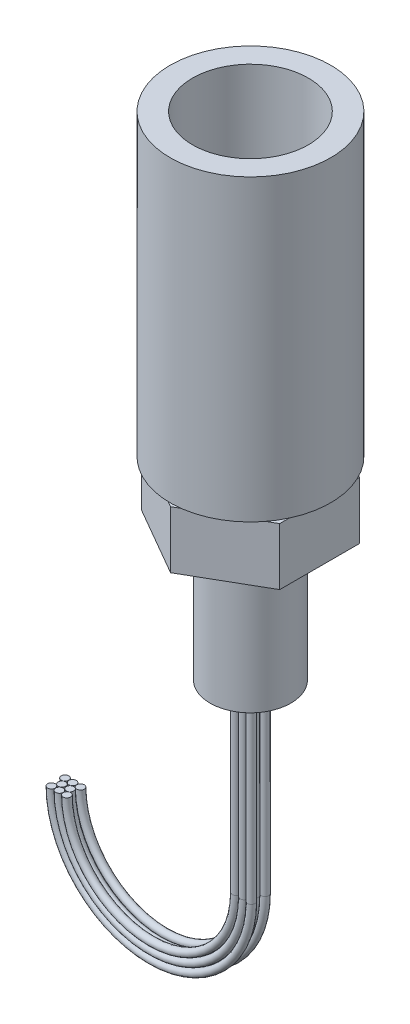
ISO-10303-21;
HEADER;
FILE_DESCRIPTION(('STEP AP214'),'2;1');
FILE_NAME('part.step','',(''),(''),'','','');
FILE_SCHEMA(('AUTOMOTIVE_DESIGN { 1 0 10303 214 1 1 1 1 }'));
ENDSEC;
DATA;
#1=APPLICATION_CONTEXT('core data for automotive mechanical design processes');
#2=APPLICATION_PROTOCOL_DEFINITION('international standard','automotive_design',2000,#1);
#3=PRODUCT_CONTEXT('',#1,'mechanical');
#4=PRODUCT('Part','Part','',(#3));
#5=PRODUCT_RELATED_PRODUCT_CATEGORY('part','',(#4));
#6=PRODUCT_DEFINITION_FORMATION('','',#4);
#7=PRODUCT_DEFINITION_CONTEXT('part definition',#1,'design');
#8=PRODUCT_DEFINITION('design','',#6,#7);
#9=PRODUCT_DEFINITION_SHAPE('','',#8);
#10=(LENGTH_UNIT() NAMED_UNIT(*) SI_UNIT(.MILLI.,.METRE.));
#11=(NAMED_UNIT(*) PLANE_ANGLE_UNIT() SI_UNIT($,.RADIAN.));
#12=(NAMED_UNIT(*) SI_UNIT($,.STERADIAN.) SOLID_ANGLE_UNIT());
#13=UNCERTAINTY_MEASURE_WITH_UNIT(LENGTH_MEASURE(1.E-05),#10,'distance_accuracy_value','');
#14=(GEOMETRIC_REPRESENTATION_CONTEXT(3) GLOBAL_UNCERTAINTY_ASSIGNED_CONTEXT((#13)) GLOBAL_UNIT_ASSIGNED_CONTEXT((#10,
#11,#12)) REPRESENTATION_CONTEXT('',''));
#15=CARTESIAN_POINT('',(0.,0.,0.));
#16=DIRECTION('',(0.,0.,1.));
#17=DIRECTION('',(1.,0.,0.));
#18=AXIS2_PLACEMENT_3D('',#15,#16,#17);
#19=CARTESIAN_POINT('',(0.,-18.280303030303,0.));
#20=DIRECTION('',(0.,-1.,0.));
#21=DIRECTION('',(0.,0.,-1.));
#22=AXIS2_PLACEMENT_3D('',#19,#20,#21);
#23=PLANE('',#22);
#24=CARTESIAN_POINT('',(-1.06679999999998,-18.280303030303,-0.938082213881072));
#25=DIRECTION('',(0.,-1.,0.));
#26=DIRECTION('',(0.,0.,-1.));
#27=AXIS2_PLACEMENT_3D('',#24,#25,#26);
#28=CIRCLE('',#27,0.5207);
#29=CARTESIAN_POINT('',(-1.06679999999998,-18.280303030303,-1.45878221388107));
#30=VERTEX_POINT('',#29);
#31=EDGE_CURVE('E925',#30,#30,#28,.T.);
#32=ORIENTED_EDGE('',*,*,#31,.F.);
#33=EDGE_LOOP('',(#32));
#34=FACE_BOUND('',#33,.T.);
#35=CARTESIAN_POINT('',(1.06680000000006,-18.280303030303,0.938082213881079));
#36=DIRECTION('',(0.,-1.,0.));
#37=DIRECTION('',(0.,0.,-1.));
#38=AXIS2_PLACEMENT_3D('',#35,#36,#37);
#39=CIRCLE('',#38,0.520700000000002);
#40=CARTESIAN_POINT('',(1.06680000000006,-18.280303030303,0.417382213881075));
#41=VERTEX_POINT('',#40);
#42=EDGE_CURVE('E937',#41,#41,#39,.T.);
#43=ORIENTED_EDGE('',*,*,#42,.F.);
#44=EDGE_LOOP('',(#43));
#45=FACE_BOUND('',#44,.T.);
#46=CARTESIAN_POINT('',(0.,-18.280303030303,-0.908738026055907));
#47=DIRECTION('',(0.,-1.,0.));
#48=DIRECTION('',(0.,0.,-1.));
#49=AXIS2_PLACEMENT_3D('',#46,#47,#48);
#50=CIRCLE('',#49,0.5207);
#51=CARTESIAN_POINT('',(0.,-18.280303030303,-1.42943802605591));
#52=VERTEX_POINT('',#51);
#53=EDGE_CURVE('E949',#52,#52,#50,.T.);
#54=ORIENTED_EDGE('',*,*,#53,.F.);
#55=EDGE_LOOP('',(#54));
#56=FACE_BOUND('',#55,.T.);
#57=CARTESIAN_POINT('',(0.,-18.280303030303,0.908738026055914));
#58=DIRECTION('',(0.,-1.,0.));
#59=DIRECTION('',(0.,0.,-1.));
#60=AXIS2_PLACEMENT_3D('',#57,#58,#59);
#61=CIRCLE('',#60,0.5207);
#62=CARTESIAN_POINT('',(0.,-18.280303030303,0.388038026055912));
#63=VERTEX_POINT('',#62);
#64=EDGE_CURVE('E382',#63,#63,#61,.T.);
#65=ORIENTED_EDGE('',*,*,#64,.F.);
#66=EDGE_LOOP('',(#65));
#67=FACE_BOUND('',#66,.T.);
#68=CARTESIAN_POINT('',(0.,-18.280303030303,0.));
#69=DIRECTION('',(0.,-1.,0.));
#70=DIRECTION('',(0.,0.,-1.));
#71=AXIS2_PLACEMENT_3D('',#68,#69,#70);
#72=CIRCLE('',#71,5.55625);
#73=CARTESIAN_POINT('',(0.,-18.280303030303,-5.55625000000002));
#74=VERTEX_POINT('',#73);
#75=EDGE_CURVE('E418',#74,#74,#72,.T.);
#76=ORIENTED_EDGE('',*,*,#75,.T.);
#77=EDGE_LOOP('',(#76));
#78=FACE_BOUND('',#77,.T.);
#79=CARTESIAN_POINT('',(0.558799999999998,-18.280303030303,0.));
#80=DIRECTION('',(0.,-1.,0.));
#81=DIRECTION('',(0.,0.,-1.));
#82=AXIS2_PLACEMENT_3D('',#79,#80,#81);
#83=CIRCLE('',#82,0.5207);
#84=CARTESIAN_POINT('',(0.558799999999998,-18.280303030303,-0.520700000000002));
#85=VERTEX_POINT('',#84);
#86=EDGE_CURVE('E955',#85,#85,#83,.T.);
#87=ORIENTED_EDGE('',*,*,#86,.F.);
#88=EDGE_LOOP('',(#87));
#89=FACE_BOUND('',#88,.T.);
#90=CARTESIAN_POINT('',(-0.558799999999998,-18.280303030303,0.));
#91=DIRECTION('',(0.,-1.,0.));
#92=DIRECTION('',(0.,0.,-1.));
#93=AXIS2_PLACEMENT_3D('',#90,#91,#92);
#94=CIRCLE('',#93,0.5207);
#95=CARTESIAN_POINT('',(-0.558799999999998,-18.280303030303,-0.520700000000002));
#96=VERTEX_POINT('',#95);
#97=EDGE_CURVE('E943',#96,#96,#94,.T.);
#98=ORIENTED_EDGE('',*,*,#97,.F.);
#99=EDGE_LOOP('',(#98));
#100=FACE_BOUND('',#99,.T.);
#101=CARTESIAN_POINT('',(-1.06639021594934,-18.280303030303,0.938304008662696));
#102=DIRECTION('',(0.,-1.,0.));
#103=DIRECTION('',(0.,0.,-1.));
#104=AXIS2_PLACEMENT_3D('',#101,#102,#103);
#105=CIRCLE('',#104,0.5207);
#106=CARTESIAN_POINT('',(-1.06639021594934,-18.280303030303,0.417604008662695));
#107=VERTEX_POINT('',#106);
#108=EDGE_CURVE('E931',#107,#107,#105,.T.);
#109=ORIENTED_EDGE('',*,*,#108,.F.);
#110=EDGE_LOOP('',(#109));
#111=FACE_BOUND('',#110,.T.);
#112=CARTESIAN_POINT('',(1.0663902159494,-18.280303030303,-0.938304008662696));
#113=DIRECTION('',(0.,-1.,0.));
#114=DIRECTION('',(0.,0.,-1.));
#115=AXIS2_PLACEMENT_3D('',#112,#113,#114);
#116=CIRCLE('',#115,0.5207);
#117=CARTESIAN_POINT('',(1.0663902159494,-18.280303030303,-1.4590040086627));
#118=VERTEX_POINT('',#117);
#119=EDGE_CURVE('E921',#118,#118,#116,.T.);
#120=ORIENTED_EDGE('',*,*,#119,.F.);
#121=EDGE_LOOP('',(#120));
#122=FACE_BOUND('',#121,.T.);
#123=ADVANCED_FACE('F42',(#34,#45,#56,#67,#78,#89,#100,#111,#122),#23,.T.);
#124=CARTESIAN_POINT('',(9.39800000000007,13.2333999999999,0.));
#125=DIRECTION('',(0.,-1.,0.));
#126=DIRECTION('',(1.,0.,0.));
#127=AXIS2_PLACEMENT_3D('',#124,#125,#126);
#128=PLANE('',#127);
#129=CARTESIAN_POINT('',(0.,13.2333999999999,0.));
#130=DIRECTION('',(0.,1.,0.));
#131=DIRECTION('',(-1.,0.,0.));
#132=AXIS2_PLACEMENT_3D('',#129,#130,#131);
#133=CIRCLE('',#132,8.8011);
#134=CARTESIAN_POINT('',(-8.80110000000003,13.2333999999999,0.));
#135=VERTEX_POINT('',#134);
#136=EDGE_CURVE('E343',#135,#135,#133,.T.);
#137=ORIENTED_EDGE('',*,*,#136,.F.);
#138=EDGE_LOOP('',(#137));
#139=FACE_BOUND('',#138,.T.);
#140=CARTESIAN_POINT('',(0.,13.2333999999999,0.));
#141=DIRECTION('',(0.,-1.,0.));
#142=DIRECTION('',(1.,0.,0.));
#143=AXIS2_PLACEMENT_3D('',#140,#141,#142);
#144=CIRCLE('',#143,9.08049999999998);
#145=CARTESIAN_POINT('',(9.08050000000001,13.2334,0.));
#146=VERTEX_POINT('',#145);
#147=EDGE_CURVE('E11',#146,#146,#144,.T.);
#148=ORIENTED_EDGE('',*,*,#147,.F.);
#149=EDGE_LOOP('',(#148));
#150=FACE_BOUND('',#149,.T.);
#151=ADVANCED_FACE('F220',(#139,#150),#128,.F.);
#152=CARTESIAN_POINT('',(8.80110000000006,17.272,0.));
#153=DIRECTION('',(0.,-1.,0.));
#154=DIRECTION('',(1.,0.,0.));
#155=AXIS2_PLACEMENT_3D('',#152,#153,#154);
#156=PLANE('',#155);
#157=CARTESIAN_POINT('',(0.,17.272,0.));
#158=DIRECTION('',(0.,1.,0.));
#159=DIRECTION('',(-1.,0.,0.));
#160=AXIS2_PLACEMENT_3D('',#157,#158,#159);
#161=CIRCLE('',#160,8.8011);
#162=CARTESIAN_POINT('',(-8.80110000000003,17.272,0.));
#163=VERTEX_POINT('',#162);
#164=EDGE_CURVE('E153',#163,#163,#161,.T.);
#165=ORIENTED_EDGE('',*,*,#164,.T.);
#166=EDGE_LOOP('',(#165));
#167=FACE_BOUND('',#166,.T.);
#168=CARTESIAN_POINT('',(0.,17.272,0.));
#169=DIRECTION('',(0.,-1.,0.));
#170=DIRECTION('',(1.,0.,0.));
#171=AXIS2_PLACEMENT_3D('',#168,#169,#170);
#172=CIRCLE('',#171,7.875);
#173=CARTESIAN_POINT('',(7.87500000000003,17.272,0.));
#174=VERTEX_POINT('',#173);
#175=EDGE_CURVE('E179',#174,#174,#172,.F.);
#176=ORIENTED_EDGE('',*,*,#175,.F.);
#177=EDGE_LOOP('',(#176));
#178=FACE_BOUND('',#177,.T.);
#179=ADVANCED_FACE('F226',(#167,#178),#156,.F.);
#180=CARTESIAN_POINT('',(0.,0.,0.));
#181=DIRECTION('',(0.,1.,0.));
#182=DIRECTION('',(-1.,0.,0.));
#183=AXIS2_PLACEMENT_3D('',#180,#181,#182);
#184=CYLINDRICAL_SURFACE('',#183,8.8011);
#185=ORIENTED_EDGE('',*,*,#164,.F.);
#186=EDGE_LOOP('',(#185));
#187=FACE_BOUND('',#186,.T.);
#188=CARTESIAN_POINT('',(0.,16.4592,0.));
#189=DIRECTION('',(0.,1.,0.));
#190=DIRECTION('',(-1.,0.,0.));
#191=AXIS2_PLACEMENT_3D('',#188,#189,#190);
#192=CIRCLE('',#191,8.8011);
#193=CARTESIAN_POINT('',(-8.80110000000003,16.4592,0.));
#194=VERTEX_POINT('',#193);
#195=EDGE_CURVE('E359',#194,#194,#192,.T.);
#196=ORIENTED_EDGE('',*,*,#195,.T.);
#197=EDGE_LOOP('',(#196));
#198=FACE_BOUND('',#197,.T.);
#199=ADVANCED_FACE('F490',(#187,#198),#184,.T.);
#200=CARTESIAN_POINT('',(9.39800000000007,16.4592,0.));
#201=DIRECTION('',(0.,-1.,0.));
#202=DIRECTION('',(1.,0.,0.));
#203=AXIS2_PLACEMENT_3D('',#200,#201,#202);
#204=PLANE('',#203);
#205=ORIENTED_EDGE('',*,*,#195,.F.);
#206=EDGE_LOOP('',(#205));
#207=FACE_BOUND('',#206,.T.);
#208=CARTESIAN_POINT('',(0.,16.4592,0.));
#209=DIRECTION('',(0.,1.,0.));
#210=DIRECTION('',(-1.,0.,0.));
#211=AXIS2_PLACEMENT_3D('',#208,#209,#210);
#212=CIRCLE('',#211,9.398);
#213=CARTESIAN_POINT('',(-9.39800000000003,16.4592,0.));
#214=VERTEX_POINT('',#213);
#215=EDGE_CURVE('E355',#214,#214,#212,.T.);
#216=ORIENTED_EDGE('',*,*,#215,.T.);
#217=EDGE_LOOP('',(#216));
#218=FACE_BOUND('',#217,.T.);
#219=ADVANCED_FACE('F496',(#207,#218),#204,.F.);
#220=CARTESIAN_POINT('',(0.,0.,0.));
#221=DIRECTION('',(0.,1.,0.));
#222=DIRECTION('',(-1.,0.,0.));
#223=AXIS2_PLACEMENT_3D('',#220,#221,#222);
#224=CYLINDRICAL_SURFACE('',#223,9.398);
#225=ORIENTED_EDGE('',*,*,#215,.F.);
#226=EDGE_LOOP('',(#225));
#227=FACE_BOUND('',#226,.T.);
#228=CARTESIAN_POINT('',(0.,14.8844,0.));
#229=DIRECTION('',(0.,1.,0.));
#230=DIRECTION('',(-1.,0.,0.));
#231=AXIS2_PLACEMENT_3D('',#228,#229,#230);
#232=CIRCLE('',#231,9.398);
#233=CARTESIAN_POINT('',(-9.39800000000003,14.8844,0.));
#234=VERTEX_POINT('',#233);
#235=EDGE_CURVE('E351',#234,#234,#232,.T.);
#236=ORIENTED_EDGE('',*,*,#235,.T.);
#237=EDGE_LOOP('',(#236));
#238=FACE_BOUND('',#237,.T.);
#239=ADVANCED_FACE('F723',(#227,#238),#224,.T.);
#240=CARTESIAN_POINT('',(8.80110000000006,14.8844,0.));
#241=DIRECTION('',(0.,1.,0.));
#242=DIRECTION('',(-1.,0.,0.));
#243=AXIS2_PLACEMENT_3D('',#240,#241,#242);
#244=PLANE('',#243);
#245=ORIENTED_EDGE('',*,*,#235,.F.);
#246=EDGE_LOOP('',(#245));
#247=FACE_BOUND('',#246,.T.);
#248=CARTESIAN_POINT('',(0.,14.8844,0.));
#249=DIRECTION('',(0.,1.,0.));
#250=DIRECTION('',(-1.,0.,0.));
#251=AXIS2_PLACEMENT_3D('',#248,#249,#250);
#252=CIRCLE('',#251,8.8011);
#253=CARTESIAN_POINT('',(-8.80110000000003,14.8844,0.));
#254=VERTEX_POINT('',#253);
#255=EDGE_CURVE('E347',#254,#254,#252,.T.);
#256=ORIENTED_EDGE('',*,*,#255,.T.);
#257=EDGE_LOOP('',(#256));
#258=FACE_BOUND('',#257,.T.);
#259=ADVANCED_FACE('F714',(#247,#258),#244,.F.);
#260=CARTESIAN_POINT('',(0.,0.,0.));
#261=DIRECTION('',(0.,1.,0.));
#262=DIRECTION('',(-1.,0.,0.));
#263=AXIS2_PLACEMENT_3D('',#260,#261,#262);
#264=CYLINDRICAL_SURFACE('',#263,8.8011);
#265=ORIENTED_EDGE('',*,*,#255,.F.);
#266=EDGE_LOOP('',(#265));
#267=FACE_BOUND('',#266,.T.);
#268=ORIENTED_EDGE('',*,*,#136,.T.);
#269=EDGE_LOOP('',(#268));
#270=FACE_BOUND('',#269,.T.);
#271=ADVANCED_FACE('F312',(#267,#270),#264,.T.);
#272=CARTESIAN_POINT('',(0.,27.682,0.));
#273=DIRECTION('',(0.,-1.,0.));
#274=DIRECTION('',(1.,0.,0.));
#275=AXIS2_PLACEMENT_3D('',#272,#273,#274);
#276=CYLINDRICAL_SURFACE('',#275,7.875);
#277=CARTESIAN_POINT('',(0.,27.682,0.));
#278=DIRECTION('',(0.,1.,0.));
#279=DIRECTION('',(-1.,0.,0.));
#280=AXIS2_PLACEMENT_3D('',#277,#278,#279);
#281=CIRCLE('',#280,7.875);
#282=CARTESIAN_POINT('',(-7.87500000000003,27.682,0.));
#283=VERTEX_POINT('',#282);
#284=EDGE_CURVE('E328',#283,#283,#281,.T.);
#285=ORIENTED_EDGE('',*,*,#284,.F.);
#286=EDGE_LOOP('',(#285));
#287=FACE_BOUND('',#286,.T.);
#288=ORIENTED_EDGE('',*,*,#175,.T.);
#289=EDGE_LOOP('',(#288));
#290=FACE_BOUND('',#289,.T.);
#291=ADVANCED_FACE('F308',(#287,#290),#276,.T.);
#292=CARTESIAN_POINT('',(0.,27.682,0.));
#293=DIRECTION('',(0.,1.,0.));
#294=DIRECTION('',(-1.,0.,0.));
#295=AXIS2_PLACEMENT_3D('',#292,#293,#294);
#296=PLANE('',#295);
#297=CARTESIAN_POINT('',(0.,27.682,1.91));
#298=DIRECTION('',(0.,1.,0.));
#299=DIRECTION('',(-1.,0.,0.));
#300=AXIS2_PLACEMENT_3D('',#297,#298,#299);
#301=CIRCLE('',#300,0.955);
#302=CARTESIAN_POINT('',(-0.954999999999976,27.682,1.91));
#303=VERTEX_POINT('',#302);
#304=EDGE_CURVE('E421',#303,#303,#301,.T.);
#305=ORIENTED_EDGE('',*,*,#304,.F.);
#306=EDGE_LOOP('',(#305));
#307=FACE_BOUND('',#306,.T.);
#308=CARTESIAN_POINT('',(-3.59210244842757,27.682,-3.5921024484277));
#309=DIRECTION('',(0.,1.,0.));
#310=DIRECTION('',(-0.707106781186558,0.,0.707106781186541));
#311=AXIS2_PLACEMENT_3D('',#308,#309,#310);
#312=CIRCLE('',#311,0.955);
#313=CARTESIAN_POINT('',(-4.26738942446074,27.682,-2.91681547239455));
#314=VERTEX_POINT('',#313);
#315=EDGE_CURVE('E429',#314,#314,#312,.T.);
#316=ORIENTED_EDGE('',*,*,#315,.F.);
#317=EDGE_LOOP('',(#316));
#318=FACE_BOUND('',#317,.T.);
#319=CARTESIAN_POINT('',(-5.08000000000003,27.682,0.));
#320=DIRECTION('',(0.,1.,0.));
#321=DIRECTION('',(0.,0.,1.));
#322=AXIS2_PLACEMENT_3D('',#319,#320,#321);
#323=CIRCLE('',#322,0.955);
#324=CARTESIAN_POINT('',(-5.08000000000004,27.682,0.954999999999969));
#325=VERTEX_POINT('',#324);
#326=EDGE_CURVE('E436',#325,#325,#323,.T.);
#327=ORIENTED_EDGE('',*,*,#326,.F.);
#328=EDGE_LOOP('',(#327));
#329=FACE_BOUND('',#328,.T.);
#330=CARTESIAN_POINT('',(-3.5921024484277,27.682,3.59210244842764));
#331=DIRECTION('',(0.,1.,0.));
#332=DIRECTION('',(0.707106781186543,0.,0.707106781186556));
#333=AXIS2_PLACEMENT_3D('',#330,#331,#332);
#334=CIRCLE('',#333,0.955);
#335=CARTESIAN_POINT('',(-4.5471024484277,27.682,3.59210244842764));
#336=VERTEX_POINT('',#335);
#337=EDGE_CURVE('E444',#336,#336,#334,.T.);
#338=ORIENTED_EDGE('',*,*,#337,.F.);
#339=EDGE_LOOP('',(#338));
#340=FACE_BOUND('',#339,.T.);
#341=CARTESIAN_POINT('',(3.59210244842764,27.682,3.59210244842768));
#342=DIRECTION('',(0.,1.,0.));
#343=DIRECTION('',(0.707106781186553,0.,-0.707106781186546));
#344=AXIS2_PLACEMENT_3D('',#341,#342,#343);
#345=CIRCLE('',#344,0.955);
#346=CARTESIAN_POINT('',(4.2673894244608,27.682,2.91681547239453));
#347=VERTEX_POINT('',#346);
#348=EDGE_CURVE('E451',#347,#347,#345,.T.);
#349=ORIENTED_EDGE('',*,*,#348,.F.);
#350=EDGE_LOOP('',(#349));
#351=FACE_BOUND('',#350,.T.);
#352=CARTESIAN_POINT('',(5.08000000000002,27.682,0.));
#353=DIRECTION('',(0.,1.,0.));
#354=DIRECTION('',(0.,0.,-1.));
#355=AXIS2_PLACEMENT_3D('',#352,#353,#354);
#356=CIRCLE('',#355,0.955);
#357=CARTESIAN_POINT('',(5.08000000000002,27.682,-0.954999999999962));
#358=VERTEX_POINT('',#357);
#359=EDGE_CURVE('E459',#358,#358,#356,.T.);
#360=ORIENTED_EDGE('',*,*,#359,.F.);
#361=EDGE_LOOP('',(#360));
#362=FACE_BOUND('',#361,.T.);
#363=CARTESIAN_POINT('',(3.59210244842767,27.682,-3.59210244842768));
#364=DIRECTION('',(0.,1.,0.));
#365=DIRECTION('',(-0.707106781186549,0.,-0.707106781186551));
#366=AXIS2_PLACEMENT_3D('',#363,#364,#365);
#367=CIRCLE('',#366,0.955);
#368=CARTESIAN_POINT('',(2.91681547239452,27.682,-4.26738942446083));
#369=VERTEX_POINT('',#368);
#370=EDGE_CURVE('E467',#369,#369,#367,.T.);
#371=ORIENTED_EDGE('',*,*,#370,.F.);
#372=EDGE_LOOP('',(#371));
#373=FACE_BOUND('',#372,.T.);
#374=CARTESIAN_POINT('',(0.,27.682,-5.08000000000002));
#375=DIRECTION('',(0.,1.,0.));
#376=DIRECTION('',(-1.,0.,0.));
#377=AXIS2_PLACEMENT_3D('',#374,#375,#376);
#378=CIRCLE('',#377,0.955);
#379=CARTESIAN_POINT('',(-0.955000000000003,27.682,-5.08000000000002));
#380=VERTEX_POINT('',#379);
#381=EDGE_CURVE('E475',#380,#380,#378,.T.);
#382=ORIENTED_EDGE('',*,*,#381,.F.);
#383=EDGE_LOOP('',(#382));
#384=FACE_BOUND('',#383,.T.);
#385=ORIENTED_EDGE('',*,*,#284,.T.);
#386=EDGE_LOOP('',(#385));
#387=FACE_BOUND('',#386,.T.);
#388=ADVANCED_FACE('F304',(#307,#318,#329,#340,#351,#362,#373,#384,#387),#296,.T.);
#389=CARTESIAN_POINT('',(8.80110000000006,17.272,0.));
#390=DIRECTION('',(0.,-1.,0.));
#391=DIRECTION('',(1.,0.,0.));
#392=AXIS2_PLACEMENT_3D('',#389,#390,#391);
#393=PLANE('',#392);
#394=CARTESIAN_POINT('',(0.,17.272,-5.08000000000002));
#395=DIRECTION('',(0.,-1.,0.));
#396=DIRECTION('',(1.,0.,0.));
#397=AXIS2_PLACEMENT_3D('',#394,#395,#396);
#398=CIRCLE('',#397,0.955);
#399=CARTESIAN_POINT('',(0.955000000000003,17.272,-5.08000000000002));
#400=VERTEX_POINT('',#399);
#401=EDGE_CURVE('E337',#400,#400,#398,.F.);
#402=ORIENTED_EDGE('',*,*,#401,.T.);
#403=EDGE_LOOP('',(#402));
#404=FACE_BOUND('',#403,.T.);
#405=ADVANCED_FACE('F300',(#404),#393,.F.);
#406=CARTESIAN_POINT('',(0.,14.5708520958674,-5.08000000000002));
#407=DIRECTION('',(0.,1.,0.));
#408=DIRECTION('',(-1.,0.,0.));
#409=AXIS2_PLACEMENT_3D('',#406,#407,#408);
#410=CYLINDRICAL_SURFACE('',#409,0.955);
#411=ORIENTED_EDGE('',*,*,#381,.T.);
#412=EDGE_LOOP('',(#411));
#413=FACE_BOUND('',#412,.T.);
#414=ORIENTED_EDGE('',*,*,#401,.F.);
#415=EDGE_LOOP('',(#414));
#416=FACE_BOUND('',#415,.T.);
#417=ADVANCED_FACE('F296',(#413,#416),#410,.F.);
#418=CARTESIAN_POINT('',(8.80110000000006,17.272,0.));
#419=DIRECTION('',(0.,-1.,0.));
#420=DIRECTION('',(1.,0.,0.));
#421=AXIS2_PLACEMENT_3D('',#418,#419,#420);
#422=PLANE('',#421);
#423=CARTESIAN_POINT('',(3.59210244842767,17.272,-3.5921024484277));
#424=DIRECTION('',(0.,-1.,0.));
#425=DIRECTION('',(1.,0.,0.));
#426=AXIS2_PLACEMENT_3D('',#423,#424,#425);
#427=CIRCLE('',#426,0.955);
#428=CARTESIAN_POINT('',(4.54710244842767,17.272,-3.5921024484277));
#429=VERTEX_POINT('',#428);
#430=EDGE_CURVE('E471',#429,#429,#427,.F.);
#431=ORIENTED_EDGE('',*,*,#430,.T.);
#432=EDGE_LOOP('',(#431));
#433=FACE_BOUND('',#432,.T.);
#434=ADVANCED_FACE('F292',(#433),#422,.F.);
#435=CARTESIAN_POINT('',(3.59210244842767,14.5708520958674,-3.5921024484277));
#436=DIRECTION('',(0.,1.,0.));
#437=DIRECTION('',(-1.,0.,0.));
#438=AXIS2_PLACEMENT_3D('',#435,#436,#437);
#439=CYLINDRICAL_SURFACE('',#438,0.955);
#440=ORIENTED_EDGE('',*,*,#370,.T.);
#441=EDGE_LOOP('',(#440));
#442=FACE_BOUND('',#441,.T.);
#443=ORIENTED_EDGE('',*,*,#430,.F.);
#444=EDGE_LOOP('',(#443));
#445=FACE_BOUND('',#444,.T.);
#446=ADVANCED_FACE('F288',(#442,#445),#439,.F.);
#447=CARTESIAN_POINT('',(8.80110000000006,17.272,0.));
#448=DIRECTION('',(0.,-1.,0.));
#449=DIRECTION('',(1.,0.,0.));
#450=AXIS2_PLACEMENT_3D('',#447,#448,#449);
#451=PLANE('',#450);
#452=CARTESIAN_POINT('',(5.08,17.272,0.));
#453=DIRECTION('',(0.,-1.,0.));
#454=DIRECTION('',(1.,0.,0.));
#455=AXIS2_PLACEMENT_3D('',#452,#453,#454);
#456=CIRCLE('',#455,0.955);
#457=CARTESIAN_POINT('',(6.035,17.272,0.));
#458=VERTEX_POINT('',#457);
#459=EDGE_CURVE('E463',#458,#458,#456,.F.);
#460=ORIENTED_EDGE('',*,*,#459,.T.);
#461=EDGE_LOOP('',(#460));
#462=FACE_BOUND('',#461,.T.);
#463=ADVANCED_FACE('F284',(#462),#451,.F.);
#464=CARTESIAN_POINT('',(5.08,14.5708520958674,0.));
#465=DIRECTION('',(0.,1.,0.));
#466=DIRECTION('',(-1.,0.,0.));
#467=AXIS2_PLACEMENT_3D('',#464,#465,#466);
#468=CYLINDRICAL_SURFACE('',#467,0.955);
#469=ORIENTED_EDGE('',*,*,#359,.T.);
#470=EDGE_LOOP('',(#469));
#471=FACE_BOUND('',#470,.T.);
#472=ORIENTED_EDGE('',*,*,#459,.F.);
#473=EDGE_LOOP('',(#472));
#474=FACE_BOUND('',#473,.T.);
#475=ADVANCED_FACE('F280',(#471,#474),#468,.F.);
#476=CARTESIAN_POINT('',(8.80110000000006,17.272,0.));
#477=DIRECTION('',(0.,-1.,0.));
#478=DIRECTION('',(1.,0.,0.));
#479=AXIS2_PLACEMENT_3D('',#476,#477,#478);
#480=PLANE('',#479);
#481=CARTESIAN_POINT('',(3.59210244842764,17.272,3.59210244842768));
#482=DIRECTION('',(0.,-1.,0.));
#483=DIRECTION('',(1.,0.,0.));
#484=AXIS2_PLACEMENT_3D('',#481,#482,#483);
#485=CIRCLE('',#484,0.955);
#486=CARTESIAN_POINT('',(4.54710244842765,17.272,3.59210244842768));
#487=VERTEX_POINT('',#486);
#488=EDGE_CURVE('E455',#487,#487,#485,.F.);
#489=ORIENTED_EDGE('',*,*,#488,.T.);
#490=EDGE_LOOP('',(#489));
#491=FACE_BOUND('',#490,.T.);
#492=ADVANCED_FACE('F276',(#491),#480,.F.);
#493=CARTESIAN_POINT('',(3.59210244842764,14.5708520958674,3.59210244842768));
#494=DIRECTION('',(0.,1.,0.));
#495=DIRECTION('',(-1.,0.,0.));
#496=AXIS2_PLACEMENT_3D('',#493,#494,#495);
#497=CYLINDRICAL_SURFACE('',#496,0.955);
#498=ORIENTED_EDGE('',*,*,#348,.T.);
#499=EDGE_LOOP('',(#498));
#500=FACE_BOUND('',#499,.T.);
#501=ORIENTED_EDGE('',*,*,#488,.F.);
#502=EDGE_LOOP('',(#501));
#503=FACE_BOUND('',#502,.T.);
#504=ADVANCED_FACE('F272',(#500,#503),#497,.F.);
#505=CARTESIAN_POINT('',(8.80110000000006,17.272,0.));
#506=DIRECTION('',(0.,-1.,0.));
#507=DIRECTION('',(1.,0.,0.));
#508=AXIS2_PLACEMENT_3D('',#505,#506,#507);
#509=PLANE('',#508);
#510=CARTESIAN_POINT('',(-3.5921024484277,17.272,3.59210244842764));
#511=DIRECTION('',(0.,-1.,0.));
#512=DIRECTION('',(1.,0.,0.));
#513=AXIS2_PLACEMENT_3D('',#510,#511,#512);
#514=CIRCLE('',#513,0.955);
#515=CARTESIAN_POINT('',(-4.5471024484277,17.272,3.59210244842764));
#516=VERTEX_POINT('',#515);
#517=EDGE_CURVE('E448',#516,#516,#514,.F.);
#518=ORIENTED_EDGE('',*,*,#517,.T.);
#519=EDGE_LOOP('',(#518));
#520=FACE_BOUND('',#519,.T.);
#521=ADVANCED_FACE('F268',(#520),#509,.F.);
#522=CARTESIAN_POINT('',(-3.5921024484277,14.5708520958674,3.59210244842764));
#523=DIRECTION('',(0.,1.,0.));
#524=DIRECTION('',(-1.,0.,0.));
#525=AXIS2_PLACEMENT_3D('',#522,#523,#524);
#526=CYLINDRICAL_SURFACE('',#525,0.955);
#527=CARTESIAN_POINT('',(-4.5471024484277,27.682,3.59210244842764));
#528=CARTESIAN_POINT('',(-4.5471024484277,27.5735625,3.59210244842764));
#529=CARTESIAN_POINT('',(-4.5471024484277,27.465125,3.59210244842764));
#530=CARTESIAN_POINT('',(-4.5471024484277,27.24825,3.59210244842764));
#531=CARTESIAN_POINT('',(-4.5471024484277,27.1398125,3.59210244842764));
#532=CARTESIAN_POINT('',(-4.5471024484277,26.9229375,3.59210244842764));
#533=CARTESIAN_POINT('',(-4.5471024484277,26.8145,3.59210244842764));
#534=CARTESIAN_POINT('',(-4.5471024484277,26.597625,3.59210244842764));
#535=CARTESIAN_POINT('',(-4.5471024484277,26.4891875,3.59210244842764));
#536=CARTESIAN_POINT('',(-4.5471024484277,26.2723125,3.59210244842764));
#537=CARTESIAN_POINT('',(-4.5471024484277,26.163875,3.59210244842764));
#538=CARTESIAN_POINT('',(-4.5471024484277,25.947,3.59210244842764));
#539=CARTESIAN_POINT('',(-4.5471024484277,25.8385625,3.59210244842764));
#540=CARTESIAN_POINT('',(-4.5471024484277,25.6216875,3.59210244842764));
#541=CARTESIAN_POINT('',(-4.5471024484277,25.51325,3.59210244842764));
#542=CARTESIAN_POINT('',(-4.5471024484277,25.296375,3.59210244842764));
#543=CARTESIAN_POINT('',(-4.5471024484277,25.1879375,3.59210244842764));
#544=CARTESIAN_POINT('',(-4.5471024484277,24.9710625,3.59210244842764));
#545=CARTESIAN_POINT('',(-4.5471024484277,24.862625,3.59210244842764));
#546=CARTESIAN_POINT('',(-4.5471024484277,24.64575,3.59210244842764));
#547=CARTESIAN_POINT('',(-4.5471024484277,24.5373125,3.59210244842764));
#548=CARTESIAN_POINT('',(-4.5471024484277,24.3204375,3.59210244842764));
#549=CARTESIAN_POINT('',(-4.5471024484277,24.212,3.59210244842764));
#550=CARTESIAN_POINT('',(-4.5471024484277,23.995125,3.59210244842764));
#551=CARTESIAN_POINT('',(-4.5471024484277,23.8866875,3.59210244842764));
#552=CARTESIAN_POINT('',(-4.5471024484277,23.6698125,3.59210244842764));
#553=CARTESIAN_POINT('',(-4.5471024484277,23.561375,3.59210244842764));
#554=CARTESIAN_POINT('',(-4.5471024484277,23.3445,3.59210244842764));
#555=CARTESIAN_POINT('',(-4.5471024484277,23.2360625,3.59210244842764));
#556=CARTESIAN_POINT('',(-4.5471024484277,23.0191875,3.59210244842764));
#557=CARTESIAN_POINT('',(-4.5471024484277,22.91075,3.59210244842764));
#558=CARTESIAN_POINT('',(-4.5471024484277,22.693875,3.59210244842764));
#559=CARTESIAN_POINT('',(-4.5471024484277,22.5854375,3.59210244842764));
#560=CARTESIAN_POINT('',(-4.5471024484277,22.3685625,3.59210244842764));
#561=CARTESIAN_POINT('',(-4.5471024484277,22.260125,3.59210244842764));
#562=CARTESIAN_POINT('',(-4.5471024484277,22.04325,3.59210244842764));
#563=CARTESIAN_POINT('',(-4.5471024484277,21.9348125,3.59210244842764));
#564=CARTESIAN_POINT('',(-4.5471024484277,21.7179375,3.59210244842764));
#565=CARTESIAN_POINT('',(-4.5471024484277,21.6095,3.59210244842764));
#566=CARTESIAN_POINT('',(-4.5471024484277,21.392625,3.59210244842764));
#567=CARTESIAN_POINT('',(-4.5471024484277,21.2841875,3.59210244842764));
#568=CARTESIAN_POINT('',(-4.5471024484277,21.0673125,3.59210244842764));
#569=CARTESIAN_POINT('',(-4.5471024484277,20.958875,3.59210244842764));
#570=CARTESIAN_POINT('',(-4.5471024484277,20.742,3.59210244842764));
#571=CARTESIAN_POINT('',(-4.5471024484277,20.6335625,3.59210244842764));
#572=CARTESIAN_POINT('',(-4.5471024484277,20.4166875,3.59210244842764));
#573=CARTESIAN_POINT('',(-4.5471024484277,20.30825,3.59210244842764));
#574=CARTESIAN_POINT('',(-4.5471024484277,20.091375,3.59210244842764));
#575=CARTESIAN_POINT('',(-4.5471024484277,19.9829375,3.59210244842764));
#576=CARTESIAN_POINT('',(-4.5471024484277,19.7660625,3.59210244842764));
#577=CARTESIAN_POINT('',(-4.5471024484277,19.657625,3.59210244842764));
#578=CARTESIAN_POINT('',(-4.5471024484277,19.44075,3.59210244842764));
#579=CARTESIAN_POINT('',(-4.5471024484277,19.3323125,3.59210244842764));
#580=CARTESIAN_POINT('',(-4.5471024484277,19.1154375,3.59210244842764));
#581=CARTESIAN_POINT('',(-4.5471024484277,19.007,3.59210244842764));
#582=CARTESIAN_POINT('',(-4.5471024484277,18.790125,3.59210244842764));
#583=CARTESIAN_POINT('',(-4.5471024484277,18.6816875,3.59210244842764));
#584=CARTESIAN_POINT('',(-4.5471024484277,18.4648125,3.59210244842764));
#585=CARTESIAN_POINT('',(-4.5471024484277,18.356375,3.59210244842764));
#586=CARTESIAN_POINT('',(-4.5471024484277,18.1395,3.59210244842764));
#587=CARTESIAN_POINT('',(-4.5471024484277,18.0310625,3.59210244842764));
#588=CARTESIAN_POINT('',(-4.5471024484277,17.8141875,3.59210244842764));
#589=CARTESIAN_POINT('',(-4.5471024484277,17.70575,3.59210244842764));
#590=CARTESIAN_POINT('',(-4.5471024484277,17.488875,3.59210244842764));
#591=CARTESIAN_POINT('',(-4.5471024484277,17.3804374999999,3.59210244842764));
#592=CARTESIAN_POINT('',(-4.5471024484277,17.272,3.59210244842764));
#593=B_SPLINE_CURVE_WITH_KNOTS('',3,(#527,#528,#529,#530,#531,#532,#533,#534,#535,#536,#537,
#538,#539,#540,#541,#542,#543,#544,#545,#546,#547,#548,#549,#550,#551,#552,#553,#554,#555,#556,
#557,#558,#559,#560,#561,#562,#563,#564,#565,#566,#567,#568,#569,#570,#571,#572,#573,#574,#575,
#576,#577,#578,#579,#580,#581,#582,#583,#584,#585,#586,#587,#588,#589,#590,#591,#592),
.UNSPECIFIED.,.F.,.F.,(4,2,2,2,2,2,2,2,2,2,2,2,2,2,2,2,2,2,2,2,2,2,2,2,2,2,2,2,2,2,2,2,4),(0.,
0.325312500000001,0.650625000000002,0.975937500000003,1.30125,1.6265625,1.95187500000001,
2.27718750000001,2.60250000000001,2.92781250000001,3.25312500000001,3.57843750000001,
3.90375000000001,4.22906250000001,4.55437500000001,4.87968750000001,5.20500000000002,
5.53031250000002,5.85562500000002,6.18093750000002,6.50625000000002,6.83156250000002,
7.15687500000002,7.48218750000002,7.80750000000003,8.13281250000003,8.45812500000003,
8.78343750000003,9.10875000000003,9.43406250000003,9.75937500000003,10.0846875,10.41),.UNSPECIFIED.);
#594=EDGE_CURVE('BSEAM264',#336,#516,#593,.T.);
#595=ORIENTED_EDGE('',*,*,#337,.T.);
#596=ORIENTED_EDGE('',*,*,#517,.F.);
#597=ORIENTED_EDGE('',*,*,#594,.T.);
#598=ORIENTED_EDGE('',*,*,#594,.F.);
#599=EDGE_LOOP('',(#595,#597,#596,#598));
#600=FACE_BOUND('',#599,.T.);
#601=ADVANCED_FACE('F264',(#600),#526,.F.);
#602=CARTESIAN_POINT('',(8.80110000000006,17.272,0.));
#603=DIRECTION('',(0.,-1.,0.));
#604=DIRECTION('',(1.,0.,0.));
#605=AXIS2_PLACEMENT_3D('',#602,#603,#604);
#606=PLANE('',#605);
#607=CARTESIAN_POINT('',(-5.08000000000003,17.272,0.));
#608=DIRECTION('',(0.,-1.,0.));
#609=DIRECTION('',(1.,0.,0.));
#610=AXIS2_PLACEMENT_3D('',#607,#608,#609);
#611=CIRCLE('',#610,0.955);
#612=CARTESIAN_POINT('',(-4.12500000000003,17.272,0.));
#613=VERTEX_POINT('',#612);
#614=EDGE_CURVE('E440',#613,#613,#611,.F.);
#615=ORIENTED_EDGE('',*,*,#614,.T.);
#616=EDGE_LOOP('',(#615));
#617=FACE_BOUND('',#616,.T.);
#618=ADVANCED_FACE('F260',(#617),#606,.F.);
#619=CARTESIAN_POINT('',(-5.08000000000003,14.5708520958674,0.));
#620=DIRECTION('',(0.,1.,0.));
#621=DIRECTION('',(-1.,0.,0.));
#622=AXIS2_PLACEMENT_3D('',#619,#620,#621);
#623=CYLINDRICAL_SURFACE('',#622,0.955);
#624=ORIENTED_EDGE('',*,*,#326,.T.);
#625=EDGE_LOOP('',(#624));
#626=FACE_BOUND('',#625,.T.);
#627=ORIENTED_EDGE('',*,*,#614,.F.);
#628=EDGE_LOOP('',(#627));
#629=FACE_BOUND('',#628,.T.);
#630=ADVANCED_FACE('F256',(#626,#629),#623,.F.);
#631=CARTESIAN_POINT('',(8.80110000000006,17.272,0.));
#632=DIRECTION('',(0.,-1.,0.));
#633=DIRECTION('',(1.,0.,0.));
#634=AXIS2_PLACEMENT_3D('',#631,#632,#633);
#635=PLANE('',#634);
#636=CARTESIAN_POINT('',(-3.59210244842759,17.272,-3.59210244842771));
#637=DIRECTION('',(0.,-1.,0.));
#638=DIRECTION('',(1.,0.,0.));
#639=AXIS2_PLACEMENT_3D('',#636,#637,#638);
#640=CIRCLE('',#639,0.955);
#641=CARTESIAN_POINT('',(-2.63710244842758,17.272,-3.59210244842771));
#642=VERTEX_POINT('',#641);
#643=EDGE_CURVE('E433',#642,#642,#640,.F.);
#644=ORIENTED_EDGE('',*,*,#643,.T.);
#645=EDGE_LOOP('',(#644));
#646=FACE_BOUND('',#645,.T.);
#647=ADVANCED_FACE('F252',(#646),#635,.F.);
#648=CARTESIAN_POINT('',(-3.59210244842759,14.5708520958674,-3.59210244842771));
#649=DIRECTION('',(0.,1.,0.));
#650=DIRECTION('',(-1.,0.,0.));
#651=AXIS2_PLACEMENT_3D('',#648,#649,#650);
#652=CYLINDRICAL_SURFACE('',#651,0.955);
#653=ORIENTED_EDGE('',*,*,#315,.T.);
#654=EDGE_LOOP('',(#653));
#655=FACE_BOUND('',#654,.T.);
#656=ORIENTED_EDGE('',*,*,#643,.F.);
#657=EDGE_LOOP('',(#656));
#658=FACE_BOUND('',#657,.T.);
#659=ADVANCED_FACE('F248',(#655,#658),#652,.F.);
#660=CARTESIAN_POINT('',(8.80110000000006,17.272,0.));
#661=DIRECTION('',(0.,-1.,0.));
#662=DIRECTION('',(1.,0.,0.));
#663=AXIS2_PLACEMENT_3D('',#660,#661,#662);
#664=PLANE('',#663);
#665=CARTESIAN_POINT('',(0.,17.272,1.90999999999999));
#666=DIRECTION('',(0.,-1.,0.));
#667=DIRECTION('',(1.,0.,0.));
#668=AXIS2_PLACEMENT_3D('',#665,#666,#667);
#669=CIRCLE('',#668,0.955);
#670=CARTESIAN_POINT('',(0.955000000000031,17.272,1.90999999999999));
#671=VERTEX_POINT('',#670);
#672=EDGE_CURVE('E425',#671,#671,#669,.F.);
#673=ORIENTED_EDGE('',*,*,#672,.T.);
#674=EDGE_LOOP('',(#673));
#675=FACE_BOUND('',#674,.T.);
#676=ADVANCED_FACE('F244',(#675),#664,.F.);
#677=CARTESIAN_POINT('',(0.,14.5708520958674,1.90999999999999));
#678=DIRECTION('',(0.,1.,0.));
#679=DIRECTION('',(-1.,0.,0.));
#680=AXIS2_PLACEMENT_3D('',#677,#678,#679);
#681=CYLINDRICAL_SURFACE('',#680,0.955);
#682=ORIENTED_EDGE('',*,*,#304,.T.);
#683=EDGE_LOOP('',(#682));
#684=FACE_BOUND('',#683,.T.);
#685=ORIENTED_EDGE('',*,*,#672,.F.);
#686=EDGE_LOOP('',(#685));
#687=FACE_BOUND('',#686,.T.);
#688=ADVANCED_FACE('F240',(#684,#687),#681,.F.);
#689=CARTESIAN_POINT('',(0.,0.,0.));
#690=DIRECTION('',(0.,1.,0.));
#691=DIRECTION('',(-1.,0.,0.));
#692=AXIS2_PLACEMENT_3D('',#689,#690,#691);
#693=CYLINDRICAL_SURFACE('',#692,9.08049999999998);
#694=CARTESIAN_POINT('',(0.,14.6106884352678,0.));
#695=DIRECTION('',(0.,1.,0.));
#696=DIRECTION('',(-1.,0.,0.));
#697=AXIS2_PLACEMENT_3D('',#694,#695,#696);
#698=CIRCLE('',#697,9.08049999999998);
#699=CARTESIAN_POINT('',(-9.08050000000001,14.6106884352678,0.));
#700=VERTEX_POINT('',#699);
#701=EDGE_CURVE('E400',#700,#700,#698,.T.);
#702=ORIENTED_EDGE('',*,*,#701,.T.);
#703=EDGE_LOOP('',(#702));
#704=FACE_BOUND('',#703,.T.);
#705=ORIENTED_EDGE('',*,*,#147,.T.);
#706=EDGE_LOOP('',(#705));
#707=FACE_BOUND('',#706,.T.);
#708=ADVANCED_FACE('F243',(#704,#707),#693,.F.);
#709=CARTESIAN_POINT('',(9.59403513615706,13.0866884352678,0.));
#710=DIRECTION('',(0.,1.,0.));
#711=DIRECTION('',(-1.,0.,0.));
#712=AXIS2_PLACEMENT_3D('',#709,#710,#711);
#713=PLANE('',#712);
#714=CARTESIAN_POINT('',(0.,13.0866884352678,0.));
#715=DIRECTION('',(0.,1.,0.));
#716=DIRECTION('',(-1.,0.,0.));
#717=AXIS2_PLACEMENT_3D('',#714,#715,#716);
#718=CIRCLE('',#717,9.59403513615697);
#719=CARTESIAN_POINT('',(-9.594035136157,13.0866884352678,0.));
#720=VERTEX_POINT('',#719);
#721=EDGE_CURVE('E404',#720,#720,#718,.T.);
#722=ORIENTED_EDGE('',*,*,#721,.F.);
#723=EDGE_LOOP('',(#722));
#724=FACE_BOUND('',#723,.T.);
#725=CARTESIAN_POINT('',(0.,13.0866884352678,0.));
#726=DIRECTION('',(0.,1.,0.));
#727=DIRECTION('',(-1.,0.,0.));
#728=AXIS2_PLACEMENT_3D('',#725,#726,#727);
#729=CIRCLE('',#728,9.398);
#730=CARTESIAN_POINT('',(-9.39800000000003,13.0866884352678,0.));
#731=VERTEX_POINT('',#730);
#732=EDGE_CURVE('E52',#731,#731,#729,.T.);
#733=ORIENTED_EDGE('',*,*,#732,.T.);
#734=EDGE_LOOP('',(#733));
#735=FACE_BOUND('',#734,.T.);
#736=ADVANCED_FACE('F199',(#724,#735),#713,.F.);
#737=CARTESIAN_POINT('',(11.049,8.36228843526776,0.));
#738=DIRECTION('',(0.,1.,0.));
#739=DIRECTION('',(-1.,0.,0.));
#740=AXIS2_PLACEMENT_3D('',#737,#738,#739);
#741=PLANE('',#740);
#742=CARTESIAN_POINT('',(0.,8.36228843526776,0.));
#743=DIRECTION('',(0.,1.,0.));
#744=DIRECTION('',(-1.,0.,0.));
#745=AXIS2_PLACEMENT_3D('',#742,#743,#744);
#746=CIRCLE('',#745,11.049);
#747=CARTESIAN_POINT('',(-11.049,8.36228843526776,0.));
#748=VERTEX_POINT('',#747);
#749=EDGE_CURVE('E370',#748,#748,#746,.T.);
#750=ORIENTED_EDGE('',*,*,#749,.F.);
#751=EDGE_LOOP('',(#750));
#752=FACE_BOUND('',#751,.T.);
#753=CARTESIAN_POINT('',(0.,8.36228843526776,0.));
#754=DIRECTION('',(0.,1.,0.));
#755=DIRECTION('',(-1.,0.,0.));
#756=AXIS2_PLACEMENT_3D('',#753,#754,#755);
#757=CIRCLE('',#756,9.08049999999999);
#758=CARTESIAN_POINT('',(-9.08050000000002,8.36228843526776,0.));
#759=VERTEX_POINT('',#758);
#760=EDGE_CURVE('E415',#759,#759,#757,.T.);
#761=ORIENTED_EDGE('',*,*,#760,.T.);
#762=EDGE_LOOP('',(#761));
#763=FACE_BOUND('',#762,.T.);
#764=ADVANCED_FACE('F615',(#752,#763),#741,.F.);
#765=CARTESIAN_POINT('',(0.,0.,0.));
#766=DIRECTION('',(0.,1.,0.));
#767=DIRECTION('',(-1.,0.,0.));
#768=AXIS2_PLACEMENT_3D('',#765,#766,#767);
#769=CYLINDRICAL_SURFACE('',#768,9.08049999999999);
#770=ORIENTED_EDGE('',*,*,#760,.F.);
#771=EDGE_LOOP('',(#770));
#772=FACE_BOUND('',#771,.T.);
#773=CARTESIAN_POINT('',(0.,11.4356884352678,0.));
#774=DIRECTION('',(0.,1.,0.));
#775=DIRECTION('',(-1.,0.,0.));
#776=AXIS2_PLACEMENT_3D('',#773,#774,#775);
#777=CIRCLE('',#776,9.08049999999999);
#778=CARTESIAN_POINT('',(-9.08050000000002,11.4356884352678,0.));
#779=VERTEX_POINT('',#778);
#780=EDGE_CURVE('E411',#779,#779,#777,.T.);
#781=ORIENTED_EDGE('',*,*,#780,.T.);
#782=EDGE_LOOP('',(#781));
#783=FACE_BOUND('',#782,.T.);
#784=ADVANCED_FACE('F607',(#772,#783),#769,.F.);
#785=CARTESIAN_POINT('',(9.08050000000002,11.4356884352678,0.));
#786=DIRECTION('',(0.,-1.,0.));
#787=DIRECTION('',(1.,0.,0.));
#788=AXIS2_PLACEMENT_3D('',#785,#786,#787);
#789=PLANE('',#788);
#790=ORIENTED_EDGE('',*,*,#780,.F.);
#791=EDGE_LOOP('',(#790));
#792=FACE_BOUND('',#791,.T.);
#793=CARTESIAN_POINT('',(0.,11.4356884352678,0.));
#794=DIRECTION('',(0.,1.,0.));
#795=DIRECTION('',(-1.,0.,0.));
#796=AXIS2_PLACEMENT_3D('',#793,#794,#795);
#797=CIRCLE('',#796,9.59403513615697);
#798=CARTESIAN_POINT('',(-9.594035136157,11.4356884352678,0.));
#799=VERTEX_POINT('',#798);
#800=EDGE_CURVE('E407',#799,#799,#797,.T.);
#801=ORIENTED_EDGE('',*,*,#800,.T.);
#802=EDGE_LOOP('',(#801));
#803=FACE_BOUND('',#802,.T.);
#804=ADVANCED_FACE('F599',(#792,#803),#789,.F.);
#805=CARTESIAN_POINT('',(0.,0.,0.));
#806=DIRECTION('',(0.,1.,0.));
#807=DIRECTION('',(-1.,0.,0.));
#808=AXIS2_PLACEMENT_3D('',#805,#806,#807);
#809=CYLINDRICAL_SURFACE('',#808,9.59403513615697);
#810=ORIENTED_EDGE('',*,*,#800,.F.);
#811=EDGE_LOOP('',(#810));
#812=FACE_BOUND('',#811,.T.);
#813=ORIENTED_EDGE('',*,*,#721,.T.);
#814=EDGE_LOOP('',(#813));
#815=FACE_BOUND('',#814,.T.);
#816=ADVANCED_FACE('F591',(#812,#815),#809,.F.);
#817=CARTESIAN_POINT('',(9.08050000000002,14.6106884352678,0.));
#818=DIRECTION('',(0.,-1.,0.));
#819=DIRECTION('',(1.,0.,0.));
#820=AXIS2_PLACEMENT_3D('',#817,#818,#819);
#821=PLANE('',#820);
#822=ORIENTED_EDGE('',*,*,#701,.F.);
#823=EDGE_LOOP('',(#822));
#824=FACE_BOUND('',#823,.T.);
#825=CARTESIAN_POINT('',(0.,14.6106884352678,0.));
#826=DIRECTION('',(0.,1.,0.));
#827=DIRECTION('',(-1.,0.,0.));
#828=AXIS2_PLACEMENT_3D('',#825,#826,#827);
#829=CIRCLE('',#828,9.59403513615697);
#830=CARTESIAN_POINT('',(-9.594035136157,14.6106884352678,0.));
#831=VERTEX_POINT('',#830);
#832=EDGE_CURVE('E396',#831,#831,#829,.T.);
#833=ORIENTED_EDGE('',*,*,#832,.T.);
#834=EDGE_LOOP('',(#833));
#835=FACE_BOUND('',#834,.T.);
#836=ADVANCED_FACE('F583',(#824,#835),#821,.F.);
#837=CARTESIAN_POINT('',(0.,0.,0.));
#838=DIRECTION('',(0.,1.,0.));
#839=DIRECTION('',(-1.,0.,0.));
#840=AXIS2_PLACEMENT_3D('',#837,#838,#839);
#841=CYLINDRICAL_SURFACE('',#840,9.59403513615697);
#842=ORIENTED_EDGE('',*,*,#832,.F.);
#843=EDGE_LOOP('',(#842));
#844=FACE_BOUND('',#843,.T.);
#845=CARTESIAN_POINT('',(0.,18.0107760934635,0.));
#846=DIRECTION('',(0.,1.,0.));
#847=DIRECTION('',(-1.,0.,0.));
#848=AXIS2_PLACEMENT_3D('',#845,#846,#847);
#849=CIRCLE('',#848,9.59403513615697);
#850=CARTESIAN_POINT('',(-9.594035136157,18.0107760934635,0.));
#851=VERTEX_POINT('',#850);
#852=EDGE_CURVE('E392',#851,#851,#849,.T.);
#853=ORIENTED_EDGE('',*,*,#852,.T.);
#854=EDGE_LOOP('',(#853));
#855=FACE_BOUND('',#854,.T.);
#856=ADVANCED_FACE('F575',(#844,#855),#841,.F.);
#857=CARTESIAN_POINT('',(9.59403513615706,18.0107760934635,0.));
#858=DIRECTION('',(0.,1.,0.));
#859=DIRECTION('',(-1.,0.,0.));
#860=AXIS2_PLACEMENT_3D('',#857,#858,#859);
#861=PLANE('',#860);
#862=ORIENTED_EDGE('',*,*,#852,.F.);
#863=EDGE_LOOP('',(#862));
#864=FACE_BOUND('',#863,.T.);
#865=CARTESIAN_POINT('',(0.,18.0107760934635,0.));
#866=DIRECTION('',(0.,1.,0.));
#867=DIRECTION('',(-1.,0.,0.));
#868=AXIS2_PLACEMENT_3D('',#865,#866,#867);
#869=CIRCLE('',#868,7.97559999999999);
#870=CARTESIAN_POINT('',(-7.97560000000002,18.0107760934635,0.));
#871=VERTEX_POINT('',#870);
#872=EDGE_CURVE('E388',#871,#871,#869,.T.);
#873=ORIENTED_EDGE('',*,*,#872,.T.);
#874=EDGE_LOOP('',(#873));
#875=FACE_BOUND('',#874,.T.);
#876=ADVANCED_FACE('F568',(#864,#875),#861,.F.);
#877=CARTESIAN_POINT('',(0.,0.,0.));
#878=DIRECTION('',(0.,1.,0.));
#879=DIRECTION('',(-1.,0.,0.));
#880=AXIS2_PLACEMENT_3D('',#877,#878,#879);
#881=CYLINDRICAL_SURFACE('',#880,7.97559999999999);
#882=ORIENTED_EDGE('',*,*,#872,.F.);
#883=EDGE_LOOP('',(#882));
#884=FACE_BOUND('',#883,.T.);
#885=CARTESIAN_POINT('',(0.,49.5102884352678,0.));
#886=DIRECTION('',(0.,1.,0.));
#887=DIRECTION('',(-1.,0.,0.));
#888=AXIS2_PLACEMENT_3D('',#885,#886,#887);
#889=CIRCLE('',#888,7.97559999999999);
#890=CARTESIAN_POINT('',(-7.9756,49.5102884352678,0.));
#891=VERTEX_POINT('',#890);
#892=EDGE_CURVE('E379',#891,#891,#889,.T.);
#893=ORIENTED_EDGE('',*,*,#892,.T.);
#894=EDGE_LOOP('',(#893));
#895=FACE_BOUND('',#894,.T.);
#896=ADVANCED_FACE('F560',(#884,#895),#881,.F.);
#897=CARTESIAN_POINT('',(7.97560000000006,49.5102884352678,0.));
#898=DIRECTION('',(0.,-1.,0.));
#899=DIRECTION('',(1.,0.,0.));
#900=AXIS2_PLACEMENT_3D('',#897,#898,#899);
#901=PLANE('',#900);
#902=ORIENTED_EDGE('',*,*,#892,.F.);
#903=EDGE_LOOP('',(#902));
#904=FACE_BOUND('',#903,.T.);
#905=CARTESIAN_POINT('',(0.,49.5102884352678,0.));
#906=DIRECTION('',(0.,1.,0.));
#907=DIRECTION('',(-1.,0.,0.));
#908=AXIS2_PLACEMENT_3D('',#905,#906,#907);
#909=CIRCLE('',#908,11.049);
#910=CARTESIAN_POINT('',(-11.049,49.5102884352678,0.));
#911=VERTEX_POINT('',#910);
#912=EDGE_CURVE('E372',#911,#911,#909,.T.);
#913=ORIENTED_EDGE('',*,*,#912,.T.);
#914=EDGE_LOOP('',(#913));
#915=FACE_BOUND('',#914,.T.);
#916=ADVANCED_FACE('F552',(#904,#915),#901,.F.);
#917=CARTESIAN_POINT('',(0.,0.,0.));
#918=DIRECTION('',(0.,1.,0.));
#919=DIRECTION('',(-1.,0.,0.));
#920=AXIS2_PLACEMENT_3D('',#917,#918,#919);
#921=CYLINDRICAL_SURFACE('',#920,11.049);
#922=ORIENTED_EDGE('',*,*,#912,.F.);
#923=EDGE_LOOP('',(#922));
#924=FACE_BOUND('',#923,.T.);
#925=ORIENTED_EDGE('',*,*,#749,.T.);
#926=EDGE_LOOP('',(#925));
#927=FACE_BOUND('',#926,.T.);
#928=ADVANCED_FACE('F238',(#924,#927),#921,.T.);
#929=CARTESIAN_POINT('',(0.,-18.280303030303,0.));
#930=DIRECTION('',(0.,1.,0.));
#931=DIRECTION('',(0.,0.,1.));
#932=AXIS2_PLACEMENT_3D('',#929,#930,#931);
#933=CYLINDRICAL_SURFACE('',#932,5.55625);
#934=ORIENTED_EDGE('',*,*,#75,.F.);
#935=EDGE_LOOP('',(#934));
#936=FACE_BOUND('',#935,.T.);
#937=CARTESIAN_POINT('',(0.,0.,0.));
#938=DIRECTION('',(0.,1.,0.));
#939=DIRECTION('',(0.,0.,1.));
#940=AXIS2_PLACEMENT_3D('',#937,#938,#939);
#941=CIRCLE('',#940,5.55625);
#942=CARTESIAN_POINT('',(0.,0.,5.55625000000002));
#943=VERTEX_POINT('',#942);
#944=EDGE_CURVE('E183',#943,#943,#941,.F.);
#945=ORIENTED_EDGE('',*,*,#944,.T.);
#946=EDGE_LOOP('',(#945));
#947=FACE_BOUND('',#946,.T.);
#948=ADVANCED_FACE('F234',(#936,#947),#933,.T.);
#949=CARTESIAN_POINT('',(-9.52500000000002,0.,-16.4977839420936));
#950=DIRECTION('',(0.,1.,0.));
#951=DIRECTION('',(0.,0.,1.));
#952=AXIS2_PLACEMENT_3D('',#949,#950,#951);
#953=PLANE('',#952);
#954=ORIENTED_EDGE('',*,*,#944,.F.);
#955=EDGE_LOOP('',(#954));
#956=FACE_BOUND('',#955,.T.);
#957=CARTESIAN_POINT('',(0.,0.,0.));
#958=DIRECTION('',(0.,-1.,0.));
#959=DIRECTION('',(0.,0.,-1.));
#960=AXIS2_PLACEMENT_3D('',#957,#958,#959);
#961=CIRCLE('',#960,6.25663579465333);
#962=CARTESIAN_POINT('',(0.,0.,-6.25663579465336));
#963=VERTEX_POINT('',#962);
#964=EDGE_CURVE('E187',#963,#963,#961,.F.);
#965=ORIENTED_EDGE('',*,*,#964,.F.);
#966=EDGE_LOOP('',(#965));
#967=FACE_BOUND('',#966,.T.);
#968=ADVANCED_FACE('F237',(#956,#967),#953,.F.);
#969=CARTESIAN_POINT('',(0.,0.284318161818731,0.));
#970=DIRECTION('',(0.,1.,0.));
#971=DIRECTION('',(-1.,0.,0.));
#972=AXIS2_PLACEMENT_3D('',#969,#970,#971);
#973=TOROIDAL_SURFACE('',#972,7.1,0.89);
#974=ORIENTED_EDGE('',*,*,#964,.T.);
#975=EDGE_LOOP('',(#974));
#976=FACE_BOUND('',#975,.T.);
#977=CARTESIAN_POINT('',(0.,0.,0.));
#978=DIRECTION('',(0.,1.,0.));
#979=DIRECTION('',(0.,0.,1.));
#980=AXIS2_PLACEMENT_3D('',#977,#978,#979);
#981=CIRCLE('',#980,7.94336420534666);
#982=CARTESIAN_POINT('',(0.,0.,7.94336420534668));
#983=VERTEX_POINT('',#982);
#984=EDGE_CURVE('E191',#983,#983,#981,.F.);
#985=ORIENTED_EDGE('',*,*,#984,.T.);
#986=EDGE_LOOP('',(#985));
#987=FACE_BOUND('',#986,.T.);
#988=ADVANCED_FACE('F232',(#976,#987),#973,.T.);
#989=DIRECTION('',(-0.866025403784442,0.,-0.500000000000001));
#990=VECTOR('',#989,1.);
#991=CARTESIAN_POINT('',(9.52499999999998,0.,-5.49926131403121));
#992=LINE('',#991,#990);
#993=CARTESIAN_POINT('',(9.52499999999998,0.,-5.49926131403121));
#994=VERTEX_POINT('',#993);
#995=CARTESIAN_POINT('',(0.,0.,-10.9985226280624));
#996=VERTEX_POINT('',#995);
#997=EDGE_CURVE('E148',#994,#996,#992,.T.);
#998=ORIENTED_EDGE('',*,*,#997,.F.);
#999=DIRECTION('',(0.,0.,-1.));
#1000=VECTOR('',#999,1.);
#1001=CARTESIAN_POINT('',(9.52500000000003,0.,5.4992613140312));
#1002=LINE('',#1001,#1000);
#1003=CARTESIAN_POINT('',(9.52500000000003,0.,5.4992613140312));
#1004=VERTEX_POINT('',#1003);
#1005=EDGE_CURVE('E98',#1004,#994,#1002,.T.);
#1006=ORIENTED_EDGE('',*,*,#1005,.F.);
#1007=DIRECTION('',(0.866025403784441,0.,-0.500000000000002));
#1008=VECTOR('',#1007,1.);
#1009=CARTESIAN_POINT('',(0.,0.,10.9985226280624));
#1010=LINE('',#1009,#1008);
#1011=CARTESIAN_POINT('',(0.,0.,10.9985226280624));
#1012=VERTEX_POINT('',#1011);
#1013=EDGE_CURVE('E92',#1012,#1004,#1010,.T.);
#1014=ORIENTED_EDGE('',*,*,#1013,.F.);
#1015=DIRECTION('',(0.866025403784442,0.,0.500000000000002));
#1016=VECTOR('',#1015,1.);
#1017=CARTESIAN_POINT('',(-9.52499999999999,0.,5.4992613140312));
#1018=LINE('',#1017,#1016);
#1019=CARTESIAN_POINT('',(-9.52499999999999,0.,5.4992613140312));
#1020=VERTEX_POINT('',#1019);
#1021=EDGE_CURVE('E133',#1020,#1012,#1018,.T.);
#1022=ORIENTED_EDGE('',*,*,#1021,.F.);
#1023=DIRECTION('',(0.,0.,1.));
#1024=VECTOR('',#1023,1.);
#1025=CARTESIAN_POINT('',(-9.52499999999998,0.,-5.4992613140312));
#1026=LINE('',#1025,#1024);
#1027=CARTESIAN_POINT('',(-9.52499999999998,0.,-5.4992613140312));
#1028=VERTEX_POINT('',#1027);
#1029=EDGE_CURVE('E156',#1028,#1020,#1026,.T.);
#1030=ORIENTED_EDGE('',*,*,#1029,.F.);
#1031=DIRECTION('',(-0.866025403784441,0.,0.500000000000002));
#1032=VECTOR('',#1031,1.);
#1033=CARTESIAN_POINT('',(0.,0.,-10.9985226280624));
#1034=LINE('',#1033,#1032);
#1035=EDGE_CURVE('E152',#996,#1028,#1034,.T.);
#1036=ORIENTED_EDGE('',*,*,#1035,.F.);
#1037=EDGE_LOOP('',(#998,#1006,#1014,#1022,#1030,#1036));
#1038=FACE_BOUND('',#1037,.T.);
#1039=ORIENTED_EDGE('',*,*,#984,.F.);
#1040=EDGE_LOOP('',(#1039));
#1041=FACE_BOUND('',#1040,.T.);
#1042=ADVANCED_FACE('F501',(#1038,#1041),#953,.F.);
#1043=CARTESIAN_POINT('',(9.52500000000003,7.87400000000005,5.4992613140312));
#1044=DIRECTION('',(-1.,0.,0.));
#1045=DIRECTION('',(0.,0.,1.));
#1046=AXIS2_PLACEMENT_3D('',#1043,#1044,#1045);
#1047=PLANE('',#1046);
#1048=ORIENTED_EDGE('',*,*,#1005,.T.);
#1049=DIRECTION('',(0.,-1.,0.));
#1050=VECTOR('',#1049,1.);
#1051=CARTESIAN_POINT('',(9.52499999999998,7.87400000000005,-5.49926131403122));
#1052=LINE('',#1051,#1050);
#1053=CARTESIAN_POINT('',(9.52499999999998,7.87400000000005,-5.49926131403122));
#1054=VERTEX_POINT('',#1053);
#1055=EDGE_CURVE('E144',#1054,#994,#1052,.T.);
#1056=ORIENTED_EDGE('',*,*,#1055,.F.);
#1057=DIRECTION('',(0.,0.,-1.));
#1058=VECTOR('',#1057,1.);
#1059=CARTESIAN_POINT('',(9.52500000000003,7.87400000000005,5.4992613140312));
#1060=LINE('',#1059,#1058);
#1061=CARTESIAN_POINT('',(9.52500000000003,7.87400000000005,5.4992613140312));
#1062=VERTEX_POINT('',#1061);
#1063=EDGE_CURVE('E62',#1062,#1054,#1060,.T.);
#1064=ORIENTED_EDGE('',*,*,#1063,.F.);
#1065=DIRECTION('',(0.,-1.,0.));
#1066=VECTOR('',#1065,1.);
#1067=CARTESIAN_POINT('',(9.52500000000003,7.87400000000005,5.4992613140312));
#1068=LINE('',#1067,#1066);
#1069=EDGE_CURVE('E136',#1062,#1004,#1068,.T.);
#1070=ORIENTED_EDGE('',*,*,#1069,.T.);
#1071=EDGE_LOOP('',(#1048,#1056,#1064,#1070));
#1072=FACE_BOUND('',#1071,.T.);
#1073=ADVANCED_FACE('F504',(#1072),#1047,.F.);
#1074=CARTESIAN_POINT('',(0.,7.87400000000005,10.9985226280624));
#1075=DIRECTION('',(-0.500000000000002,0.,-0.866025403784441));
#1076=DIRECTION('',(-0.866025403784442,0.,0.500000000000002));
#1077=AXIS2_PLACEMENT_3D('',#1074,#1075,#1076);
#1078=PLANE('',#1077);
#1079=ORIENTED_EDGE('',*,*,#1013,.T.);
#1080=ORIENTED_EDGE('',*,*,#1069,.F.);
#1081=DIRECTION('',(0.866025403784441,0.,-0.500000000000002));
#1082=VECTOR('',#1081,1.);
#1083=CARTESIAN_POINT('',(0.,7.87400000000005,10.9985226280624));
#1084=LINE('',#1083,#1082);
#1085=CARTESIAN_POINT('',(0.,7.87400000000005,10.9985226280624));
#1086=VERTEX_POINT('',#1085);
#1087=EDGE_CURVE('E122',#1086,#1062,#1084,.T.);
#1088=ORIENTED_EDGE('',*,*,#1087,.F.);
#1089=DIRECTION('',(0.,-1.,0.));
#1090=VECTOR('',#1089,1.);
#1091=CARTESIAN_POINT('',(0.,7.87400000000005,10.9985226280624));
#1092=LINE('',#1091,#1090);
#1093=EDGE_CURVE('E130',#1086,#1012,#1092,.T.);
#1094=ORIENTED_EDGE('',*,*,#1093,.T.);
#1095=EDGE_LOOP('',(#1079,#1080,#1088,#1094));
#1096=FACE_BOUND('',#1095,.T.);
#1097=ADVANCED_FACE('F138',(#1096),#1078,.F.);
#1098=CARTESIAN_POINT('',(-9.52499999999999,7.87400000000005,5.4992613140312));
#1099=DIRECTION('',(0.500000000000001,0.,-0.866025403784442));
#1100=DIRECTION('',(-0.866025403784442,0.,-0.500000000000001));
#1101=AXIS2_PLACEMENT_3D('',#1098,#1099,#1100);
#1102=PLANE('',#1101);
#1103=ORIENTED_EDGE('',*,*,#1021,.T.);
#1104=ORIENTED_EDGE('',*,*,#1093,.F.);
#1105=DIRECTION('',(0.866025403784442,0.,0.500000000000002));
#1106=VECTOR('',#1105,1.);
#1107=CARTESIAN_POINT('',(-9.52499999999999,7.87400000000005,5.4992613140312));
#1108=LINE('',#1107,#1106);
#1109=CARTESIAN_POINT('',(-9.52499999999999,7.87400000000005,5.4992613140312));
#1110=VERTEX_POINT('',#1109);
#1111=EDGE_CURVE('E117',#1110,#1086,#1108,.T.);
#1112=ORIENTED_EDGE('',*,*,#1111,.F.);
#1113=DIRECTION('',(0.,-1.,0.));
#1114=VECTOR('',#1113,1.);
#1115=CARTESIAN_POINT('',(-9.52499999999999,7.87400000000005,5.4992613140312));
#1116=LINE('',#1115,#1114);
#1117=EDGE_CURVE('E135',#1110,#1020,#1116,.T.);
#1118=ORIENTED_EDGE('',*,*,#1117,.T.);
#1119=EDGE_LOOP('',(#1103,#1104,#1112,#1118));
#1120=FACE_BOUND('',#1119,.T.);
#1121=ADVANCED_FACE('F131',(#1120),#1102,.F.);
#1122=CARTESIAN_POINT('',(-9.52499999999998,7.87400000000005,-5.49926131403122));
#1123=DIRECTION('',(1.,0.,0.));
#1124=DIRECTION('',(0.,0.,-1.));
#1125=AXIS2_PLACEMENT_3D('',#1122,#1123,#1124);
#1126=PLANE('',#1125);
#1127=ORIENTED_EDGE('',*,*,#1029,.T.);
#1128=ORIENTED_EDGE('',*,*,#1117,.F.);
#1129=DIRECTION('',(0.,0.,1.));
#1130=VECTOR('',#1129,1.);
#1131=CARTESIAN_POINT('',(-9.52499999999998,7.87400000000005,-5.49926131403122));
#1132=LINE('',#1131,#1130);
#1133=CARTESIAN_POINT('',(-9.52499999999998,7.87400000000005,-5.49926131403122));
#1134=VERTEX_POINT('',#1133);
#1135=EDGE_CURVE('E124',#1134,#1110,#1132,.T.);
#1136=ORIENTED_EDGE('',*,*,#1135,.F.);
#1137=DIRECTION('',(0.,-1.,0.));
#1138=VECTOR('',#1137,1.);
#1139=CARTESIAN_POINT('',(-9.52499999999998,7.87400000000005,-5.49926131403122));
#1140=LINE('',#1139,#1138);
#1141=EDGE_CURVE('E172',#1134,#1028,#1140,.T.);
#1142=ORIENTED_EDGE('',*,*,#1141,.T.);
#1143=EDGE_LOOP('',(#1127,#1128,#1136,#1142));
#1144=FACE_BOUND('',#1143,.T.);
#1145=ADVANCED_FACE('F512',(#1144),#1126,.F.);
#1146=CARTESIAN_POINT('',(0.,7.87400000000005,-10.9985226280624));
#1147=DIRECTION('',(0.500000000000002,0.,0.866025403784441));
#1148=DIRECTION('',(0.866025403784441,0.,-0.500000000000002));
#1149=AXIS2_PLACEMENT_3D('',#1146,#1147,#1148);
#1150=PLANE('',#1149);
#1151=ORIENTED_EDGE('',*,*,#1035,.T.);
#1152=ORIENTED_EDGE('',*,*,#1141,.F.);
#1153=DIRECTION('',(-0.866025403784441,0.,0.500000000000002));
#1154=VECTOR('',#1153,1.);
#1155=CARTESIAN_POINT('',(0.,7.87400000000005,-10.9985226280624));
#1156=LINE('',#1155,#1154);
#1157=CARTESIAN_POINT('',(0.,7.87400000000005,-10.9985226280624));
#1158=VERTEX_POINT('',#1157);
#1159=EDGE_CURVE('E108',#1158,#1134,#1156,.T.);
#1160=ORIENTED_EDGE('',*,*,#1159,.F.);
#1161=DIRECTION('',(0.,-1.,0.));
#1162=VECTOR('',#1161,1.);
#1163=CARTESIAN_POINT('',(0.,7.87400000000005,-10.9985226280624));
#1164=LINE('',#1163,#1162);
#1165=EDGE_CURVE('E176',#1158,#996,#1164,.T.);
#1166=ORIENTED_EDGE('',*,*,#1165,.T.);
#1167=EDGE_LOOP('',(#1151,#1152,#1160,#1166));
#1168=FACE_BOUND('',#1167,.T.);
#1169=ADVANCED_FACE('F514',(#1168),#1150,.F.);
#1170=CARTESIAN_POINT('',(9.52499999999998,7.87400000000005,-5.49926131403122));
#1171=DIRECTION('',(-0.500000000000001,0.,0.866025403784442));
#1172=DIRECTION('',(0.866025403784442,0.,0.500000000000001));
#1173=AXIS2_PLACEMENT_3D('',#1170,#1171,#1172);
#1174=PLANE('',#1173);
#1175=ORIENTED_EDGE('',*,*,#997,.T.);
#1176=ORIENTED_EDGE('',*,*,#1165,.F.);
#1177=DIRECTION('',(-0.866025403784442,0.,-0.500000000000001));
#1178=VECTOR('',#1177,1.);
#1179=CARTESIAN_POINT('',(9.52499999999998,7.87400000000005,-5.49926131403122));
#1180=LINE('',#1179,#1178);
#1181=EDGE_CURVE('E165',#1054,#1158,#1180,.T.);
#1182=ORIENTED_EDGE('',*,*,#1181,.F.);
#1183=ORIENTED_EDGE('',*,*,#1055,.T.);
#1184=EDGE_LOOP('',(#1175,#1176,#1182,#1183));
#1185=FACE_BOUND('',#1184,.T.);
#1186=ADVANCED_FACE('F44',(#1185),#1174,.F.);
#1187=CARTESIAN_POINT('',(-9.52500000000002,7.87400000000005,-16.4977839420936));
#1188=DIRECTION('',(0.,1.,0.));
#1189=DIRECTION('',(0.,0.,1.));
#1190=AXIS2_PLACEMENT_3D('',#1187,#1188,#1189);
#1191=PLANE('',#1190);
#1192=ORIENTED_EDGE('',*,*,#1181,.T.);
#1193=ORIENTED_EDGE('',*,*,#1159,.T.);
#1194=ORIENTED_EDGE('',*,*,#1135,.T.);
#1195=ORIENTED_EDGE('',*,*,#1111,.T.);
#1196=ORIENTED_EDGE('',*,*,#1087,.T.);
#1197=ORIENTED_EDGE('',*,*,#1063,.T.);
#1198=EDGE_LOOP('',(#1192,#1193,#1194,#1195,#1196,#1197));
#1199=FACE_BOUND('',#1198,.T.);
#1200=CARTESIAN_POINT('',(0.,7.87400000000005,0.));
#1201=DIRECTION('',(0.,1.,0.));
#1202=DIRECTION('',(-1.,0.,0.));
#1203=AXIS2_PLACEMENT_3D('',#1200,#1201,#1202);
#1204=CIRCLE('',#1203,8.8011);
#1205=CARTESIAN_POINT('',(-8.80110000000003,7.87400000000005,0.));
#1206=VERTEX_POINT('',#1205);
#1207=EDGE_CURVE('E326',#1206,#1206,#1204,.T.);
#1208=ORIENTED_EDGE('',*,*,#1207,.F.);
#1209=EDGE_LOOP('',(#1208));
#1210=FACE_BOUND('',#1209,.T.);
#1211=ADVANCED_FACE('F119',(#1199,#1210),#1191,.T.);
#1212=CARTESIAN_POINT('',(0.,0.,0.));
#1213=DIRECTION('',(0.,1.,0.));
#1214=DIRECTION('',(-1.,0.,0.));
#1215=AXIS2_PLACEMENT_3D('',#1212,#1213,#1214);
#1216=CYLINDRICAL_SURFACE('',#1215,8.8011);
#1217=CARTESIAN_POINT('',(0.,11.6586,0.));
#1218=DIRECTION('',(0.,1.,0.));
#1219=DIRECTION('',(-1.,0.,0.));
#1220=AXIS2_PLACEMENT_3D('',#1217,#1218,#1219);
#1221=CIRCLE('',#1220,8.8011);
#1222=CARTESIAN_POINT('',(-8.80110000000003,11.6586,0.));
#1223=VERTEX_POINT('',#1222);
#1224=EDGE_CURVE('E323',#1223,#1223,#1221,.T.);
#1225=ORIENTED_EDGE('',*,*,#1224,.F.);
#1226=EDGE_LOOP('',(#1225));
#1227=FACE_BOUND('',#1226,.T.);
#1228=ORIENTED_EDGE('',*,*,#1207,.T.);
#1229=EDGE_LOOP('',(#1228));
#1230=FACE_BOUND('',#1229,.T.);
#1231=ADVANCED_FACE('F214',(#1227,#1230),#1216,.T.);
#1232=CARTESIAN_POINT('',(8.80110000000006,11.6586,0.));
#1233=DIRECTION('',(0.,1.,0.));
#1234=DIRECTION('',(-1.,0.,0.));
#1235=AXIS2_PLACEMENT_3D('',#1232,#1233,#1234);
#1236=PLANE('',#1235);
#1237=CARTESIAN_POINT('',(0.,11.6586,0.));
#1238=DIRECTION('',(0.,1.,0.));
#1239=DIRECTION('',(-1.,0.,0.));
#1240=AXIS2_PLACEMENT_3D('',#1237,#1238,#1239);
#1241=CIRCLE('',#1240,9.398);
#1242=CARTESIAN_POINT('',(-9.39800000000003,11.6586,0.));
#1243=VERTEX_POINT('',#1242);
#1244=EDGE_CURVE('E333',#1243,#1243,#1241,.T.);
#1245=ORIENTED_EDGE('',*,*,#1244,.F.);
#1246=EDGE_LOOP('',(#1245));
#1247=FACE_BOUND('',#1246,.T.);
#1248=ORIENTED_EDGE('',*,*,#1224,.T.);
#1249=EDGE_LOOP('',(#1248));
#1250=FACE_BOUND('',#1249,.T.);
#1251=ADVANCED_FACE('F204',(#1247,#1250),#1236,.F.);
#1252=CARTESIAN_POINT('',(0.,0.,0.));
#1253=DIRECTION('',(0.,1.,0.));
#1254=DIRECTION('',(-1.,0.,0.));
#1255=AXIS2_PLACEMENT_3D('',#1252,#1253,#1254);
#1256=CYLINDRICAL_SURFACE('',#1255,9.398);
#1257=ORIENTED_EDGE('',*,*,#1244,.T.);
#1258=EDGE_LOOP('',(#1257));
#1259=FACE_BOUND('',#1258,.T.);
#1260=ORIENTED_EDGE('',*,*,#732,.F.);
#1261=EDGE_LOOP('',(#1260));
#1262=FACE_BOUND('',#1261,.T.);
#1263=ADVANCED_FACE('F201',(#1259,#1262),#1256,.T.);
#1264=CARTESIAN_POINT('',(0.,-43.680303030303,0.908738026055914));
#1265=DIRECTION('',(0.,1.,0.));
#1266=DIRECTION('',(0.,0.,1.));
#1267=AXIS2_PLACEMENT_3D('',#1264,#1265,#1266);
#1268=CYLINDRICAL_SURFACE('',#1267,0.5207);
#1269=CARTESIAN_POINT('',(0.,-43.680303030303,0.908738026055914));
#1270=DIRECTION('',(0.,-1.,0.));
#1271=DIRECTION('',(0.,0.,-1.));
#1272=AXIS2_PLACEMENT_3D('',#1269,#1270,#1271);
#1273=CIRCLE('',#1272,0.5207);
#1274=CARTESIAN_POINT('',(0.520699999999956,-43.680303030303,0.908738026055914));
#1275=VERTEX_POINT('',#1274);
#1276=EDGE_CURVE('E373',#1275,#1275,#1273,.T.);
#1277=ORIENTED_EDGE('',*,*,#1276,.F.);
#1278=EDGE_LOOP('',(#1277));
#1279=FACE_BOUND('',#1278,.T.);
#1280=ORIENTED_EDGE('',*,*,#64,.T.);
#1281=EDGE_LOOP('',(#1280));
#1282=FACE_BOUND('',#1281,.T.);
#1283=ADVANCED_FACE('F203',(#1279,#1282),#1268,.T.);
#1284=CARTESIAN_POINT('',(0.558799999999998,-43.680303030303,0.));
#1285=DIRECTION('',(0.,1.,0.));
#1286=DIRECTION('',(0.,0.,1.));
#1287=AXIS2_PLACEMENT_3D('',#1284,#1285,#1286);
#1288=CYLINDRICAL_SURFACE('',#1287,0.5207);
#1289=CARTESIAN_POINT('',(0.558799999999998,-43.680303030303,0.));
#1290=DIRECTION('',(0.,-1.,0.));
#1291=DIRECTION('',(0.,0.,-1.));
#1292=AXIS2_PLACEMENT_3D('',#1289,#1290,#1291);
#1293=CIRCLE('',#1292,0.5207);
#1294=CARTESIAN_POINT('',(1.07949999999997,-43.680303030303,0.));
#1295=VERTEX_POINT('',#1294);
#1296=EDGE_CURVE('E958',#1295,#1295,#1293,.T.);
#1297=ORIENTED_EDGE('',*,*,#1296,.F.);
#1298=EDGE_LOOP('',(#1297));
#1299=FACE_BOUND('',#1298,.T.);
#1300=ORIENTED_EDGE('',*,*,#86,.T.);
#1301=EDGE_LOOP('',(#1300));
#1302=FACE_BOUND('',#1301,.T.);
#1303=ADVANCED_FACE('F211',(#1299,#1302),#1288,.T.);
#1304=CARTESIAN_POINT('',(0.,-43.680303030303,-0.908738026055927));
#1305=DIRECTION('',(0.,1.,0.));
#1306=DIRECTION('',(0.,0.,1.));
#1307=AXIS2_PLACEMENT_3D('',#1304,#1305,#1306);
#1308=CYLINDRICAL_SURFACE('',#1307,0.5207);
#1309=CARTESIAN_POINT('',(0.,-43.680303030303,-0.908738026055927));
#1310=DIRECTION('',(0.,-1.,0.));
#1311=DIRECTION('',(0.,0.,-1.));
#1312=AXIS2_PLACEMENT_3D('',#1309,#1310,#1311);
#1313=CIRCLE('',#1312,0.5207);
#1314=CARTESIAN_POINT('',(0.520699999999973,-43.680303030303,-0.908738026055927));
#1315=VERTEX_POINT('',#1314);
#1316=EDGE_CURVE('E952',#1315,#1315,#1313,.T.);
#1317=ORIENTED_EDGE('',*,*,#1316,.F.);
#1318=EDGE_LOOP('',(#1317));
#1319=FACE_BOUND('',#1318,.T.);
#1320=ORIENTED_EDGE('',*,*,#53,.T.);
#1321=EDGE_LOOP('',(#1320));
#1322=FACE_BOUND('',#1321,.T.);
#1323=ADVANCED_FACE('F805',(#1319,#1322),#1308,.T.);
#1324=CARTESIAN_POINT('',(-0.558799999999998,-43.680303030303,0.));
#1325=DIRECTION('',(0.,1.,0.));
#1326=DIRECTION('',(0.,0.,1.));
#1327=AXIS2_PLACEMENT_3D('',#1324,#1325,#1326);
#1328=CYLINDRICAL_SURFACE('',#1327,0.5207);
#1329=CARTESIAN_POINT('',(-0.558799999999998,-43.680303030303,0.));
#1330=DIRECTION('',(0.,-1.,0.));
#1331=DIRECTION('',(0.,0.,-1.));
#1332=AXIS2_PLACEMENT_3D('',#1329,#1330,#1331);
#1333=CIRCLE('',#1332,0.5207);
#1334=CARTESIAN_POINT('',(-0.038100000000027,-43.680303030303,0.));
#1335=VERTEX_POINT('',#1334);
#1336=EDGE_CURVE('E946',#1335,#1335,#1333,.T.);
#1337=ORIENTED_EDGE('',*,*,#1336,.F.);
#1338=EDGE_LOOP('',(#1337));
#1339=FACE_BOUND('',#1338,.T.);
#1340=ORIENTED_EDGE('',*,*,#97,.T.);
#1341=EDGE_LOOP('',(#1340));
#1342=FACE_BOUND('',#1341,.T.);
#1343=ADVANCED_FACE('F809',(#1339,#1342),#1328,.T.);
#1344=CARTESIAN_POINT('',(1.06680000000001,-43.680303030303,0.938082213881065));
#1345=DIRECTION('',(0.,1.,0.));
#1346=DIRECTION('',(0.,0.,1.));
#1347=AXIS2_PLACEMENT_3D('',#1344,#1345,#1346);
#1348=CYLINDRICAL_SURFACE('',#1347,0.520700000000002);
#1349=CARTESIAN_POINT('',(1.06680000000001,-43.680303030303,0.938082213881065));
#1350=DIRECTION('',(0.,-1.,0.));
#1351=DIRECTION('',(0.,0.,-1.));
#1352=AXIS2_PLACEMENT_3D('',#1349,#1350,#1351);
#1353=CIRCLE('',#1352,0.520700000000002);
#1354=CARTESIAN_POINT('',(1.5875,-43.680303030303,0.938082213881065));
#1355=VERTEX_POINT('',#1354);
#1356=EDGE_CURVE('E940',#1355,#1355,#1353,.T.);
#1357=ORIENTED_EDGE('',*,*,#1356,.F.);
#1358=EDGE_LOOP('',(#1357));
#1359=FACE_BOUND('',#1358,.T.);
#1360=ORIENTED_EDGE('',*,*,#42,.T.);
#1361=EDGE_LOOP('',(#1360));
#1362=FACE_BOUND('',#1361,.T.);
#1363=ADVANCED_FACE('F813',(#1359,#1362),#1348,.T.);
#1364=CARTESIAN_POINT('',(-1.06639021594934,-43.680303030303,0.938304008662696));
#1365=DIRECTION('',(0.,1.,0.));
#1366=DIRECTION('',(0.,0.,1.));
#1367=AXIS2_PLACEMENT_3D('',#1364,#1365,#1366);
#1368=CYLINDRICAL_SURFACE('',#1367,0.5207);
#1369=CARTESIAN_POINT('',(-1.06639021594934,-43.680303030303,0.938304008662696));
#1370=DIRECTION('',(0.,-1.,0.));
#1371=DIRECTION('',(0.,0.,-1.));
#1372=AXIS2_PLACEMENT_3D('',#1369,#1370,#1371);
#1373=CIRCLE('',#1372,0.5207);
#1374=CARTESIAN_POINT('',(-0.545690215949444,-43.680303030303,0.938304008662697));
#1375=VERTEX_POINT('',#1374);
#1376=EDGE_CURVE('E934',#1375,#1375,#1373,.T.);
#1377=ORIENTED_EDGE('',*,*,#1376,.F.);
#1378=EDGE_LOOP('',(#1377));
#1379=FACE_BOUND('',#1378,.T.);
#1380=ORIENTED_EDGE('',*,*,#108,.T.);
#1381=EDGE_LOOP('',(#1380));
#1382=FACE_BOUND('',#1381,.T.);
#1383=ADVANCED_FACE('F817',(#1379,#1382),#1368,.T.);
#1384=CARTESIAN_POINT('',(-1.06680000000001,-43.680303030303,-0.938082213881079));
#1385=DIRECTION('',(0.,1.,0.));
#1386=DIRECTION('',(0.,0.,1.));
#1387=AXIS2_PLACEMENT_3D('',#1384,#1385,#1386);
#1388=CYLINDRICAL_SURFACE('',#1387,0.5207);
#1389=CARTESIAN_POINT('',(-1.06680000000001,-43.680303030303,-0.938082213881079));
#1390=DIRECTION('',(0.,-1.,0.));
#1391=DIRECTION('',(0.,0.,-1.));
#1392=AXIS2_PLACEMENT_3D('',#1389,#1390,#1391);
#1393=CIRCLE('',#1392,0.5207);
#1394=CARTESIAN_POINT('',(-0.546099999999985,-43.680303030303,-0.938082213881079));
#1395=VERTEX_POINT('',#1394);
#1396=EDGE_CURVE('E928',#1395,#1395,#1393,.T.);
#1397=ORIENTED_EDGE('',*,*,#1396,.F.);
#1398=EDGE_LOOP('',(#1397));
#1399=FACE_BOUND('',#1398,.T.);
#1400=ORIENTED_EDGE('',*,*,#31,.T.);
#1401=EDGE_LOOP('',(#1400));
#1402=FACE_BOUND('',#1401,.T.);
#1403=ADVANCED_FACE('F821',(#1399,#1402),#1388,.T.);
#1404=CARTESIAN_POINT('',(1.06639021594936,-43.680303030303,-0.93830400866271));
#1405=DIRECTION('',(0.,1.,0.));
#1406=DIRECTION('',(0.,0.,1.));
#1407=AXIS2_PLACEMENT_3D('',#1404,#1405,#1406);
#1408=CYLINDRICAL_SURFACE('',#1407,0.5207);
#1409=CARTESIAN_POINT('',(1.06639021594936,-43.680303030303,-0.93830400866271));
#1410=DIRECTION('',(0.,-1.,0.));
#1411=DIRECTION('',(0.,0.,-1.));
#1412=AXIS2_PLACEMENT_3D('',#1409,#1410,#1411);
#1413=CIRCLE('',#1412,0.5207);
#1414=CARTESIAN_POINT('',(1.58709021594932,-43.680303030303,-0.938304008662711));
#1415=VERTEX_POINT('',#1414);
#1416=EDGE_CURVE('E922',#1415,#1415,#1413,.T.);
#1417=ORIENTED_EDGE('',*,*,#1416,.F.);
#1418=EDGE_LOOP('',(#1417));
#1419=FACE_BOUND('',#1418,.T.);
#1420=ORIENTED_EDGE('',*,*,#119,.T.);
#1421=EDGE_LOOP('',(#1420));
#1422=FACE_BOUND('',#1421,.T.);
#1423=ADVANCED_FACE('F825',(#1419,#1422),#1408,.T.);
#1424=CARTESIAN_POINT('',(-12.7,-43.680303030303,0.));
#1425=DIRECTION('',(0.,0.,1.));
#1426=DIRECTION('',(1.,0.,0.));
#1427=AXIS2_PLACEMENT_3D('',#1424,#1425,#1426);
#1428=TOROIDAL_SURFACE('',#1427,13.2588,0.5207);
#1429=CARTESIAN_POINT('',(-25.9588,-43.6803030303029,0.));
#1430=DIRECTION('',(0.,1.,0.));
#1431=DIRECTION('',(0.,0.,-1.));
#1432=AXIS2_PLACEMENT_3D('',#1429,#1430,#1431);
#1433=CIRCLE('',#1432,0.5207);
#1434=CARTESIAN_POINT('',(-26.4795,-43.6803030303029,0.));
#1435=VERTEX_POINT('',#1434);
#1436=EDGE_CURVE('E918',#1435,#1435,#1433,.T.);
#1437=CARTESIAN_POINT('',(-12.7,-43.680303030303,0.));
#1438=DIRECTION('',(0.,0.,1.));
#1439=DIRECTION('',(1.,0.,0.));
#1440=AXIS2_PLACEMENT_3D('',#1437,#1438,#1439);
#1441=CIRCLE('',#1440,13.7795);
#1442=EDGE_CURVE('',#1435,#1295,#1441,.T.);
#1443=ORIENTED_EDGE('',*,*,#1436,.F.);
#1444=ORIENTED_EDGE('',*,*,#1296,.T.);
#1445=ORIENTED_EDGE('',*,*,#1442,.T.);
#1446=ORIENTED_EDGE('',*,*,#1442,.F.);
#1447=EDGE_LOOP('',(#1443,#1445,#1444,#1446));
#1448=FACE_BOUND('',#1447,.T.);
#1449=ADVANCED_FACE('F829',(#1448),#1428,.T.);
#1450=CARTESIAN_POINT('',(-25.9588,-43.6803030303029,0.));
#1451=DIRECTION('',(0.,1.,0.));
#1452=DIRECTION('',(0.,0.,-1.));
#1453=AXIS2_PLACEMENT_3D('',#1450,#1451,#1452);
#1454=PLANE('',#1453);
#1455=ORIENTED_EDGE('',*,*,#1436,.T.);
#1456=EDGE_LOOP('',(#1455));
#1457=FACE_BOUND('',#1456,.T.);
#1458=ADVANCED_FACE('F831',(#1457),#1454,.T.);
#1459=CARTESIAN_POINT('',(-12.7,-43.680303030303,-0.938304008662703));
#1460=DIRECTION('',(0.,0.,1.));
#1461=DIRECTION('',(1.,0.,0.));
#1462=AXIS2_PLACEMENT_3D('',#1459,#1460,#1461);
#1463=TOROIDAL_SURFACE('',#1462,13.7663902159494,0.5207);
#1464=CARTESIAN_POINT('',(-26.4663902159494,-43.6803030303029,-0.938304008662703));
#1465=DIRECTION('',(0.,1.,0.));
#1466=DIRECTION('',(0.,0.,-1.));
#1467=AXIS2_PLACEMENT_3D('',#1464,#1465,#1466);
#1468=CIRCLE('',#1467,0.5207);
#1469=CARTESIAN_POINT('',(-26.9870902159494,-43.6803030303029,-0.938304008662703));
#1470=VERTEX_POINT('',#1469);
#1471=EDGE_CURVE('E915',#1470,#1470,#1468,.T.);
#1472=CARTESIAN_POINT('',(-12.7,-43.680303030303,-0.938304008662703));
#1473=DIRECTION('',(0.,0.,1.));
#1474=DIRECTION('',(1.,0.,0.));
#1475=AXIS2_PLACEMENT_3D('',#1472,#1473,#1474);
#1476=CIRCLE('',#1475,14.2870902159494);
#1477=EDGE_CURVE('',#1470,#1415,#1476,.T.);
#1478=ORIENTED_EDGE('',*,*,#1471,.F.);
#1479=ORIENTED_EDGE('',*,*,#1416,.T.);
#1480=ORIENTED_EDGE('',*,*,#1477,.T.);
#1481=ORIENTED_EDGE('',*,*,#1477,.F.);
#1482=EDGE_LOOP('',(#1478,#1480,#1479,#1481));
#1483=FACE_BOUND('',#1482,.T.);
#1484=ADVANCED_FACE('F838',(#1483),#1463,.T.);
#1485=CARTESIAN_POINT('',(-26.4663902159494,-43.6803030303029,-0.938304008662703));
#1486=DIRECTION('',(0.,1.,0.));
#1487=DIRECTION('',(0.,0.,-1.));
#1488=AXIS2_PLACEMENT_3D('',#1485,#1486,#1487);
#1489=PLANE('',#1488);
#1490=ORIENTED_EDGE('',*,*,#1471,.T.);
#1491=EDGE_LOOP('',(#1490));
#1492=FACE_BOUND('',#1491,.T.);
#1493=ADVANCED_FACE('F835',(#1492),#1489,.T.);
#1494=CARTESIAN_POINT('',(-12.7,-43.680303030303,-0.908738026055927));
#1495=DIRECTION('',(0.,0.,1.));
#1496=DIRECTION('',(1.,0.,0.));
#1497=AXIS2_PLACEMENT_3D('',#1494,#1495,#1496);
#1498=TOROIDAL_SURFACE('',#1497,12.7,0.5207);
#1499=CARTESIAN_POINT('',(-25.4,-43.6803030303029,-0.9087380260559));
#1500=DIRECTION('',(0.,1.,0.));
#1501=DIRECTION('',(0.,0.,-1.));
#1502=AXIS2_PLACEMENT_3D('',#1499,#1500,#1501);
#1503=CIRCLE('',#1502,0.5207);
#1504=CARTESIAN_POINT('',(-25.9207,-43.6803030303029,-0.908738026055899));
#1505=VERTEX_POINT('',#1504);
#1506=EDGE_CURVE('E912',#1505,#1505,#1503,.T.);
#1507=CARTESIAN_POINT('',(-12.7,-43.680303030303,-0.908738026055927));
#1508=DIRECTION('',(0.,0.,1.));
#1509=DIRECTION('',(1.,0.,0.));
#1510=AXIS2_PLACEMENT_3D('',#1507,#1508,#1509);
#1511=CIRCLE('',#1510,13.2207);
#1512=EDGE_CURVE('',#1505,#1315,#1511,.T.);
#1513=ORIENTED_EDGE('',*,*,#1506,.F.);
#1514=ORIENTED_EDGE('',*,*,#1316,.T.);
#1515=ORIENTED_EDGE('',*,*,#1512,.T.);
#1516=ORIENTED_EDGE('',*,*,#1512,.F.);
#1517=EDGE_LOOP('',(#1513,#1515,#1514,#1516));
#1518=FACE_BOUND('',#1517,.T.);
#1519=ADVANCED_FACE('F846',(#1518),#1498,.T.);
#1520=CARTESIAN_POINT('',(-25.4,-43.6803030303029,-0.9087380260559));
#1521=DIRECTION('',(0.,1.,0.));
#1522=DIRECTION('',(0.,0.,-1.));
#1523=AXIS2_PLACEMENT_3D('',#1520,#1521,#1522);
#1524=PLANE('',#1523);
#1525=ORIENTED_EDGE('',*,*,#1506,.T.);
#1526=EDGE_LOOP('',(#1525));
#1527=FACE_BOUND('',#1526,.T.);
#1528=ADVANCED_FACE('F843',(#1527),#1524,.T.);
#1529=CARTESIAN_POINT('',(-12.7,-43.680303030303,-0.938082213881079));
#1530=DIRECTION('',(0.,0.,1.));
#1531=DIRECTION('',(1.,0.,0.));
#1532=AXIS2_PLACEMENT_3D('',#1529,#1530,#1531);
#1533=TOROIDAL_SURFACE('',#1532,11.6332,0.5207);
#1534=CARTESIAN_POINT('',(-24.3332,-43.6803030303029,-0.938082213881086));
#1535=DIRECTION('',(0.,1.,0.));
#1536=DIRECTION('',(0.,0.,-1.));
#1537=AXIS2_PLACEMENT_3D('',#1534,#1535,#1536);
#1538=CIRCLE('',#1537,0.5207);
#1539=CARTESIAN_POINT('',(-24.8539,-43.6803030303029,-0.938082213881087));
#1540=VERTEX_POINT('',#1539);
#1541=EDGE_CURVE('E909',#1540,#1540,#1538,.T.);
#1542=CARTESIAN_POINT('',(-12.7,-43.680303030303,-0.938082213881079));
#1543=DIRECTION('',(0.,0.,1.));
#1544=DIRECTION('',(1.,0.,0.));
#1545=AXIS2_PLACEMENT_3D('',#1542,#1543,#1544);
#1546=CIRCLE('',#1545,12.1539);
#1547=EDGE_CURVE('',#1540,#1395,#1546,.T.);
#1548=ORIENTED_EDGE('',*,*,#1541,.F.);
#1549=ORIENTED_EDGE('',*,*,#1396,.T.);
#1550=ORIENTED_EDGE('',*,*,#1547,.T.);
#1551=ORIENTED_EDGE('',*,*,#1547,.F.);
#1552=EDGE_LOOP('',(#1548,#1550,#1549,#1551));
#1553=FACE_BOUND('',#1552,.T.);
#1554=ADVANCED_FACE('F854',(#1553),#1533,.T.);
#1555=CARTESIAN_POINT('',(-24.3332,-43.6803030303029,-0.938082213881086));
#1556=DIRECTION('',(0.,1.,0.));
#1557=DIRECTION('',(0.,0.,-1.));
#1558=AXIS2_PLACEMENT_3D('',#1555,#1556,#1557);
#1559=PLANE('',#1558);
#1560=ORIENTED_EDGE('',*,*,#1541,.T.);
#1561=EDGE_LOOP('',(#1560));
#1562=FACE_BOUND('',#1561,.T.);
#1563=ADVANCED_FACE('F851',(#1562),#1559,.T.);
#1564=CARTESIAN_POINT('',(-12.7,-43.680303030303,0.));
#1565=DIRECTION('',(0.,0.,1.));
#1566=DIRECTION('',(1.,0.,0.));
#1567=AXIS2_PLACEMENT_3D('',#1564,#1565,#1566);
#1568=TOROIDAL_SURFACE('',#1567,12.1412,0.5207);
#1569=CARTESIAN_POINT('',(-24.8412000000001,-43.6803030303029,0.));
#1570=DIRECTION('',(0.,1.,0.));
#1571=DIRECTION('',(0.,0.,-1.));
#1572=AXIS2_PLACEMENT_3D('',#1569,#1570,#1571);
#1573=CIRCLE('',#1572,0.5207);
#1574=CARTESIAN_POINT('',(-25.3619,-43.6803030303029,0.));
#1575=VERTEX_POINT('',#1574);
#1576=EDGE_CURVE('E906',#1575,#1575,#1573,.T.);
#1577=CARTESIAN_POINT('',(-12.7,-43.680303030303,0.));
#1578=DIRECTION('',(0.,0.,1.));
#1579=DIRECTION('',(1.,0.,0.));
#1580=AXIS2_PLACEMENT_3D('',#1577,#1578,#1579);
#1581=CIRCLE('',#1580,12.6619);
#1582=EDGE_CURVE('',#1575,#1335,#1581,.T.);
#1583=ORIENTED_EDGE('',*,*,#1576,.F.);
#1584=ORIENTED_EDGE('',*,*,#1336,.T.);
#1585=ORIENTED_EDGE('',*,*,#1582,.T.);
#1586=ORIENTED_EDGE('',*,*,#1582,.F.);
#1587=EDGE_LOOP('',(#1583,#1585,#1584,#1586));
#1588=FACE_BOUND('',#1587,.T.);
#1589=ADVANCED_FACE('F862',(#1588),#1568,.T.);
#1590=CARTESIAN_POINT('',(-24.8412000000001,-43.6803030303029,0.));
#1591=DIRECTION('',(0.,1.,0.));
#1592=DIRECTION('',(0.,0.,-1.));
#1593=AXIS2_PLACEMENT_3D('',#1590,#1591,#1592);
#1594=PLANE('',#1593);
#1595=ORIENTED_EDGE('',*,*,#1576,.T.);
#1596=EDGE_LOOP('',(#1595));
#1597=FACE_BOUND('',#1596,.T.);
#1598=ADVANCED_FACE('F859',(#1597),#1594,.T.);
#1599=CARTESIAN_POINT('',(-12.7000000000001,-43.680303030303,0.938304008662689));
#1600=DIRECTION('',(0.,0.,1.));
#1601=DIRECTION('',(1.,0.,0.));
#1602=AXIS2_PLACEMENT_3D('',#1599,#1600,#1601);
#1603=TOROIDAL_SURFACE('',#1602,11.6336097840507,0.5207);
#1604=CARTESIAN_POINT('',(-24.3336097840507,-43.6803030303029,0.938304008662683));
#1605=DIRECTION('',(0.,1.,0.));
#1606=DIRECTION('',(0.,0.,-1.));
#1607=AXIS2_PLACEMENT_3D('',#1604,#1605,#1606);
#1608=CIRCLE('',#1607,0.5207);
#1609=CARTESIAN_POINT('',(-24.8543097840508,-43.6803030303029,0.938304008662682));
#1610=VERTEX_POINT('',#1609);
#1611=EDGE_CURVE('E901',#1610,#1610,#1608,.T.);
#1612=CARTESIAN_POINT('',(-12.7000000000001,-43.680303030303,0.938304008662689));
#1613=DIRECTION('',(0.,0.,1.));
#1614=DIRECTION('',(1.,0.,0.));
#1615=AXIS2_PLACEMENT_3D('',#1612,#1613,#1614);
#1616=CIRCLE('',#1615,12.1543097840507);
#1617=EDGE_CURVE('',#1610,#1375,#1616,.T.);
#1618=ORIENTED_EDGE('',*,*,#1611,.F.);
#1619=ORIENTED_EDGE('',*,*,#1376,.T.);
#1620=ORIENTED_EDGE('',*,*,#1617,.T.);
#1621=ORIENTED_EDGE('',*,*,#1617,.F.);
#1622=EDGE_LOOP('',(#1618,#1620,#1619,#1621));
#1623=FACE_BOUND('',#1622,.T.);
#1624=ADVANCED_FACE('F870',(#1623),#1603,.T.);
#1625=CARTESIAN_POINT('',(-24.3336097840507,-43.6803030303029,0.938304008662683));
#1626=DIRECTION('',(0.,1.,0.));
#1627=DIRECTION('',(0.,0.,-1.));
#1628=AXIS2_PLACEMENT_3D('',#1625,#1626,#1627);
#1629=PLANE('',#1628);
#1630=ORIENTED_EDGE('',*,*,#1611,.T.);
#1631=EDGE_LOOP('',(#1630));
#1632=FACE_BOUND('',#1631,.T.);
#1633=ADVANCED_FACE('F867',(#1632),#1629,.T.);
#1634=CARTESIAN_POINT('',(-12.7,-43.680303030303,0.908738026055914));
#1635=DIRECTION('',(0.,0.,1.));
#1636=DIRECTION('',(1.,0.,0.));
#1637=AXIS2_PLACEMENT_3D('',#1634,#1635,#1636);
#1638=TOROIDAL_SURFACE('',#1637,12.7,0.5207);
#1639=CARTESIAN_POINT('',(-25.4000000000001,-43.6803030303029,0.908738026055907));
#1640=DIRECTION('',(0.,1.,0.));
#1641=DIRECTION('',(0.,0.,-1.));
#1642=AXIS2_PLACEMENT_3D('',#1639,#1640,#1641);
#1643=CIRCLE('',#1642,0.5207);
#1644=CARTESIAN_POINT('',(-25.9207,-43.6803030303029,0.908738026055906));
#1645=VERTEX_POINT('',#1644);
#1646=EDGE_CURVE('E898',#1645,#1645,#1643,.T.);
#1647=CARTESIAN_POINT('',(-12.7,-43.680303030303,0.908738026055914));
#1648=DIRECTION('',(0.,0.,1.));
#1649=DIRECTION('',(1.,0.,0.));
#1650=AXIS2_PLACEMENT_3D('',#1647,#1648,#1649);
#1651=CIRCLE('',#1650,13.2207);
#1652=EDGE_CURVE('',#1645,#1275,#1651,.T.);
#1653=ORIENTED_EDGE('',*,*,#1646,.F.);
#1654=ORIENTED_EDGE('',*,*,#1276,.T.);
#1655=ORIENTED_EDGE('',*,*,#1652,.T.);
#1656=ORIENTED_EDGE('',*,*,#1652,.F.);
#1657=EDGE_LOOP('',(#1653,#1655,#1654,#1656));
#1658=FACE_BOUND('',#1657,.T.);
#1659=ADVANCED_FACE('F878',(#1658),#1638,.T.);
#1660=CARTESIAN_POINT('',(-25.4000000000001,-43.6803030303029,0.908738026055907));
#1661=DIRECTION('',(0.,1.,0.));
#1662=DIRECTION('',(0.,0.,-1.));
#1663=AXIS2_PLACEMENT_3D('',#1660,#1661,#1662);
#1664=PLANE('',#1663);
#1665=ORIENTED_EDGE('',*,*,#1646,.T.);
#1666=EDGE_LOOP('',(#1665));
#1667=FACE_BOUND('',#1666,.T.);
#1668=ADVANCED_FACE('F875',(#1667),#1664,.T.);
#1669=CARTESIAN_POINT('',(-12.7,-43.680303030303,0.938082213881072));
#1670=DIRECTION('',(0.,0.,1.));
#1671=DIRECTION('',(1.,0.,0.));
#1672=AXIS2_PLACEMENT_3D('',#1669,#1670,#1671);
#1673=TOROIDAL_SURFACE('',#1672,13.7668,0.520700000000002);
#1674=CARTESIAN_POINT('',(-26.4668,-43.6803030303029,0.938082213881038));
#1675=DIRECTION('',(0.,1.,0.));
#1676=DIRECTION('',(0.,0.,-1.));
#1677=AXIS2_PLACEMENT_3D('',#1674,#1675,#1676);
#1678=CIRCLE('',#1677,0.520700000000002);
#1679=CARTESIAN_POINT('',(-26.9875,-43.6803030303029,0.938082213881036));
#1680=VERTEX_POINT('',#1679);
#1681=EDGE_CURVE('E897',#1680,#1680,#1678,.T.);
#1682=CARTESIAN_POINT('',(-12.7,-43.680303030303,0.938082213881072));
#1683=DIRECTION('',(0.,0.,1.));
#1684=DIRECTION('',(1.,0.,0.));
#1685=AXIS2_PLACEMENT_3D('',#1682,#1683,#1684);
#1686=CIRCLE('',#1685,14.2875);
#1687=EDGE_CURVE('',#1680,#1355,#1686,.T.);
#1688=ORIENTED_EDGE('',*,*,#1681,.F.);
#1689=ORIENTED_EDGE('',*,*,#1356,.T.);
#1690=ORIENTED_EDGE('',*,*,#1687,.T.);
#1691=ORIENTED_EDGE('',*,*,#1687,.F.);
#1692=EDGE_LOOP('',(#1688,#1690,#1689,#1691));
#1693=FACE_BOUND('',#1692,.T.);
#1694=ADVANCED_FACE('F886',(#1693),#1673,.T.);
#1695=CARTESIAN_POINT('',(-26.4668,-43.6803030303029,0.938082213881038));
#1696=DIRECTION('',(0.,1.,0.));
#1697=DIRECTION('',(0.,0.,-1.));
#1698=AXIS2_PLACEMENT_3D('',#1695,#1696,#1697);
#1699=PLANE('',#1698);
#1700=ORIENTED_EDGE('',*,*,#1681,.T.);
#1701=EDGE_LOOP('',(#1700));
#1702=FACE_BOUND('',#1701,.T.);
#1703=ADVANCED_FACE('F883',(#1702),#1699,.T.);
#1704=CLOSED_SHELL('',(#123,#151,#179,#199,#219,#239,#259,#271,#291,#388,#405,#417,#434,#446,
#463,#475,#492,#504,#521,#601,#618,#630,#647,#659,#676,#688,#708,#736,#764,#784,#804,#816,#836,
#856,#876,#896,#916,#928,#948,#968,#988,#1042,#1073,#1097,#1121,#1145,#1169,#1186,#1211,#1231,
#1251,#1263,#1283,#1303,#1323,#1343,#1363,#1383,#1403,#1423,#1449,#1458,#1484,#1493,#1519,#1528,
#1554,#1563,#1589,#1598,#1624,#1633,#1659,#1668,#1694,#1703));
#1705=MANIFOLD_SOLID_BREP('B2',#1704);
#1706=ADVANCED_BREP_SHAPE_REPRESENTATION('',(#18,#1705),#14);
#1707=SHAPE_DEFINITION_REPRESENTATION(#9,#1706);
ENDSEC;
END-ISO-10303-21;
